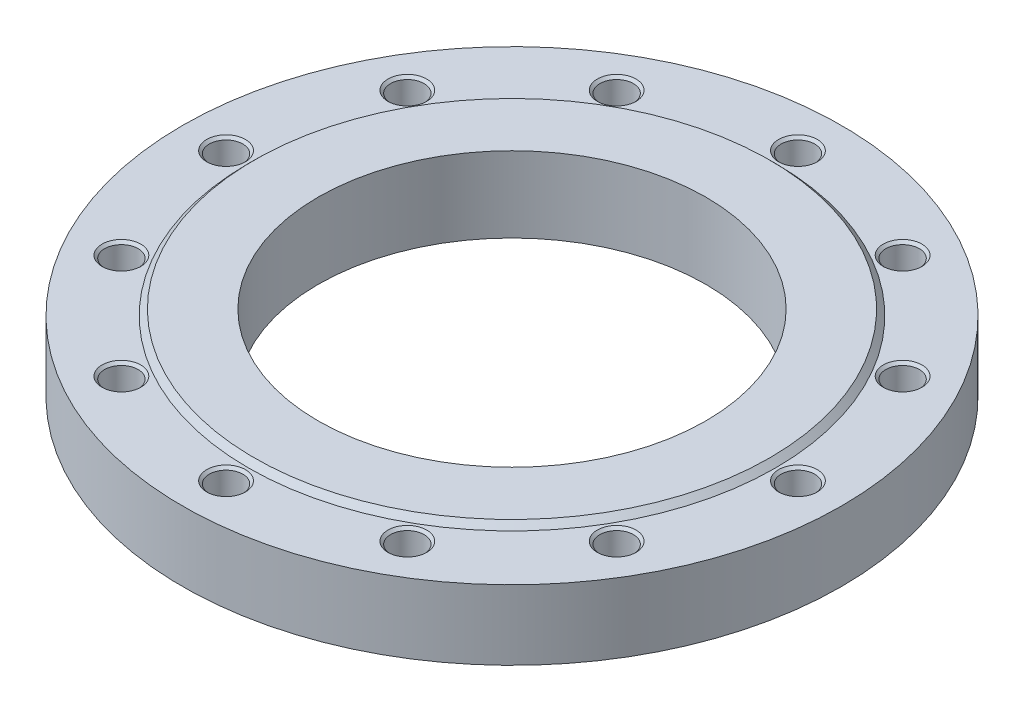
ISO-10303-21;
HEADER;
FILE_DESCRIPTION(('STEP AP214'),'2;1');
FILE_NAME('part.step','',(''),(''),'','','');
FILE_SCHEMA(('AUTOMOTIVE_DESIGN { 1 0 10303 214 1 1 1 1 }'));
ENDSEC;
DATA;
#1=APPLICATION_CONTEXT('core data for automotive mechanical design processes');
#2=APPLICATION_PROTOCOL_DEFINITION('international standard','automotive_design',2000,#1);
#3=PRODUCT_CONTEXT('',#1,'mechanical');
#4=PRODUCT('Part','Part','',(#3));
#5=PRODUCT_RELATED_PRODUCT_CATEGORY('part','',(#4));
#6=PRODUCT_DEFINITION_FORMATION('','',#4);
#7=PRODUCT_DEFINITION_CONTEXT('part definition',#1,'design');
#8=PRODUCT_DEFINITION('design','',#6,#7);
#9=PRODUCT_DEFINITION_SHAPE('','',#8);
#10=(LENGTH_UNIT() NAMED_UNIT(*) SI_UNIT(.MILLI.,.METRE.));
#11=(NAMED_UNIT(*) PLANE_ANGLE_UNIT() SI_UNIT($,.RADIAN.));
#12=(NAMED_UNIT(*) SI_UNIT($,.STERADIAN.) SOLID_ANGLE_UNIT());
#13=UNCERTAINTY_MEASURE_WITH_UNIT(LENGTH_MEASURE(1.E-05),#10,'distance_accuracy_value','');
#14=(GEOMETRIC_REPRESENTATION_CONTEXT(3) GLOBAL_UNCERTAINTY_ASSIGNED_CONTEXT((#13)) GLOBAL_UNIT_ASSIGNED_CONTEXT((#10,
#11,#12)) REPRESENTATION_CONTEXT('',''));
#15=CARTESIAN_POINT('',(0.,0.,0.));
#16=DIRECTION('',(0.,0.,1.));
#17=DIRECTION('',(1.,0.,0.));
#18=AXIS2_PLACEMENT_3D('',#15,#16,#17);
#19=CARTESIAN_POINT('',(0.,18.,0.));
#20=DIRECTION('',(0.,-1.,0.));
#21=DIRECTION('',(1.,0.,0.));
#22=AXIS2_PLACEMENT_3D('',#19,#20,#21);
#23=CYLINDRICAL_SURFACE('',#22,170.);
#24=CARTESIAN_POINT('',(0.,0.,0.));
#25=DIRECTION('',(0.,1.,0.));
#26=DIRECTION('',(1.,0.,0.));
#27=AXIS2_PLACEMENT_3D('',#24,#25,#26);
#28=CIRCLE('',#27,170.);
#29=CARTESIAN_POINT('',(170.,0.,0.));
#30=VERTEX_POINT('',#29);
#31=EDGE_CURVE('E9',#30,#30,#28,.T.);
#32=ORIENTED_EDGE('',*,*,#31,.T.);
#33=EDGE_LOOP('',(#32));
#34=FACE_BOUND('',#33,.T.);
#35=CARTESIAN_POINT('',(0.,36.,0.));
#36=DIRECTION('',(0.,1.,0.));
#37=DIRECTION('',(1.,0.,0.));
#38=AXIS2_PLACEMENT_3D('',#35,#36,#37);
#39=CIRCLE('',#38,170.);
#40=CARTESIAN_POINT('',(170.,36.,0.));
#41=VERTEX_POINT('',#40);
#42=EDGE_CURVE('E197',#41,#41,#39,.T.);
#43=ORIENTED_EDGE('',*,*,#42,.F.);
#44=EDGE_LOOP('',(#43));
#45=FACE_BOUND('',#44,.T.);
#46=ADVANCED_FACE('F15',(#34,#45),#23,.T.);
#47=CARTESIAN_POINT('',(135.,0.,0.));
#48=DIRECTION('',(0.,-1.,0.));
#49=DIRECTION('',(-1.,0.,0.));
#50=AXIS2_PLACEMENT_3D('',#47,#48,#49);
#51=PLANE('',#50);
#52=CARTESIAN_POINT('',(0.,0.,0.));
#53=DIRECTION('',(0.,1.,0.));
#54=DIRECTION('',(1.,0.,0.));
#55=AXIS2_PLACEMENT_3D('',#52,#53,#54);
#56=CIRCLE('',#55,100.);
#57=CARTESIAN_POINT('',(100.,0.,0.));
#58=VERTEX_POINT('',#57);
#59=EDGE_CURVE('E24',#58,#58,#56,.T.);
#60=ORIENTED_EDGE('',*,*,#59,.T.);
#61=EDGE_LOOP('',(#60));
#62=FACE_BOUND('',#61,.T.);
#63=ORIENTED_EDGE('',*,*,#31,.F.);
#64=EDGE_LOOP('',(#63));
#65=FACE_BOUND('',#64,.T.);
#66=ADVANCED_FACE('F407',(#62,#65),#51,.T.);
#67=CARTESIAN_POINT('',(0.,19.5,0.));
#68=DIRECTION('',(0.,-1.,0.));
#69=DIRECTION('',(1.,0.,0.));
#70=AXIS2_PLACEMENT_3D('',#67,#68,#69);
#71=CYLINDRICAL_SURFACE('',#70,100.);
#72=CARTESIAN_POINT('',(0.,39.,0.));
#73=DIRECTION('',(0.,1.,0.));
#74=DIRECTION('',(1.,0.,0.));
#75=AXIS2_PLACEMENT_3D('',#72,#73,#74);
#76=CIRCLE('',#75,100.);
#77=CARTESIAN_POINT('',(100.,39.,0.));
#78=VERTEX_POINT('',#77);
#79=EDGE_CURVE('E190',#78,#78,#76,.T.);
#80=ORIENTED_EDGE('',*,*,#79,.T.);
#81=EDGE_LOOP('',(#80));
#82=FACE_BOUND('',#81,.T.);
#83=ORIENTED_EDGE('',*,*,#59,.F.);
#84=EDGE_LOOP('',(#83));
#85=FACE_BOUND('',#84,.T.);
#86=ADVANCED_FACE('F191',(#82,#85),#71,.F.);
#87=CARTESIAN_POINT('',(116.5,39.,0.));
#88=DIRECTION('',(0.,1.,0.));
#89=DIRECTION('',(1.,0.,0.));
#90=AXIS2_PLACEMENT_3D('',#87,#88,#89);
#91=PLANE('',#90);
#92=CARTESIAN_POINT('',(0.,39.,0.));
#93=DIRECTION('',(0.,1.,0.));
#94=DIRECTION('',(1.,0.,0.));
#95=AXIS2_PLACEMENT_3D('',#92,#93,#94);
#96=CIRCLE('',#95,133.);
#97=CARTESIAN_POINT('',(133.,39.,0.));
#98=VERTEX_POINT('',#97);
#99=EDGE_CURVE('E194',#98,#98,#96,.T.);
#100=ORIENTED_EDGE('',*,*,#99,.T.);
#101=EDGE_LOOP('',(#100));
#102=FACE_BOUND('',#101,.T.);
#103=ORIENTED_EDGE('',*,*,#79,.F.);
#104=EDGE_LOOP('',(#103));
#105=FACE_BOUND('',#104,.T.);
#106=ADVANCED_FACE('F542',(#102,#105),#91,.T.);
#107=CARTESIAN_POINT('',(0.,37.5,0.));
#108=DIRECTION('',(0.,-1.,0.));
#109=DIRECTION('',(1.,0.,0.));
#110=AXIS2_PLACEMENT_3D('',#107,#108,#109);
#111=CONICAL_SURFACE('',#110,134.5,0.785398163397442);
#112=CARTESIAN_POINT('',(0.,36.,0.));
#113=DIRECTION('',(0.,1.,0.));
#114=DIRECTION('',(1.,0.,0.));
#115=AXIS2_PLACEMENT_3D('',#112,#113,#114);
#116=CIRCLE('',#115,136.);
#117=CARTESIAN_POINT('',(136.,36.,0.));
#118=VERTEX_POINT('',#117);
#119=EDGE_CURVE('E18',#118,#118,#116,.T.);
#120=ORIENTED_EDGE('',*,*,#119,.T.);
#121=EDGE_LOOP('',(#120));
#122=FACE_BOUND('',#121,.T.);
#123=ORIENTED_EDGE('',*,*,#99,.F.);
#124=EDGE_LOOP('',(#123));
#125=FACE_BOUND('',#124,.T.);
#126=ADVANCED_FACE('F421',(#122,#125),#111,.T.);
#127=CARTESIAN_POINT('',(153.,36.,0.));
#128=DIRECTION('',(0.,1.,0.));
#129=DIRECTION('',(1.,0.,0.));
#130=AXIS2_PLACEMENT_3D('',#127,#128,#129);
#131=PLANE('',#130);
#132=ORIENTED_EDGE('',*,*,#42,.T.);
#133=EDGE_LOOP('',(#132));
#134=FACE_BOUND('',#133,.T.);
#135=ORIENTED_EDGE('',*,*,#119,.F.);
#136=EDGE_LOOP('',(#135));
#137=FACE_BOUND('',#136,.T.);
#138=CARTESIAN_POINT('',(147.5,36.,0.));
#139=DIRECTION('',(0.,-1.,0.));
#140=DIRECTION('',(1.,0.,0.));
#141=AXIS2_PLACEMENT_3D('',#138,#139,#140);
#142=CIRCLE('',#141,10.);
#143=CARTESIAN_POINT('',(157.5,36.,0.));
#144=VERTEX_POINT('',#143);
#145=EDGE_CURVE('E249',#144,#144,#142,.T.);
#146=ORIENTED_EDGE('',*,*,#145,.T.);
#147=EDGE_LOOP('',(#146));
#148=FACE_BOUND('',#147,.T.);
#149=CARTESIAN_POINT('',(127.738747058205,36.,-73.75));
#150=DIRECTION('',(0.,-1.,0.));
#151=DIRECTION('',(0.866025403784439,0.,-0.5));
#152=AXIS2_PLACEMENT_3D('',#149,#150,#151);
#153=CIRCLE('',#152,10.);
#154=CARTESIAN_POINT('',(136.399001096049,36.,-78.75));
#155=VERTEX_POINT('',#154);
#156=EDGE_CURVE('E226',#155,#155,#153,.T.);
#157=ORIENTED_EDGE('',*,*,#156,.T.);
#158=EDGE_LOOP('',(#157));
#159=FACE_BOUND('',#158,.T.);
#160=CARTESIAN_POINT('',(73.75,36.,-127.738747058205));
#161=DIRECTION('',(0.,-1.,0.));
#162=DIRECTION('',(0.5,0.,-0.866025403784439));
#163=AXIS2_PLACEMENT_3D('',#160,#161,#162);
#164=CIRCLE('',#163,10.);
#165=CARTESIAN_POINT('',(78.75,36.,-136.399001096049));
#166=VERTEX_POINT('',#165);
#167=EDGE_CURVE('E259',#166,#166,#164,.T.);
#168=ORIENTED_EDGE('',*,*,#167,.T.);
#169=EDGE_LOOP('',(#168));
#170=FACE_BOUND('',#169,.T.);
#171=CARTESIAN_POINT('',(0.,36.,-147.5));
#172=DIRECTION('',(0.,-1.,0.));
#173=DIRECTION('',(0.,0.,-1.));
#174=AXIS2_PLACEMENT_3D('',#171,#172,#173);
#175=CIRCLE('',#174,10.);
#176=CARTESIAN_POINT('',(0.,36.,-157.5));
#177=VERTEX_POINT('',#176);
#178=EDGE_CURVE('E243',#177,#177,#175,.T.);
#179=ORIENTED_EDGE('',*,*,#178,.T.);
#180=EDGE_LOOP('',(#179));
#181=FACE_BOUND('',#180,.T.);
#182=CARTESIAN_POINT('',(-73.75,36.,-127.738747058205));
#183=DIRECTION('',(0.,-1.,0.));
#184=DIRECTION('',(-0.5,0.,-0.866025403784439));
#185=AXIS2_PLACEMENT_3D('',#182,#183,#184);
#186=CIRCLE('',#185,10.);
#187=CARTESIAN_POINT('',(-78.75,36.,-136.399001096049));
#188=VERTEX_POINT('',#187);
#189=EDGE_CURVE('E222',#188,#188,#186,.T.);
#190=ORIENTED_EDGE('',*,*,#189,.T.);
#191=EDGE_LOOP('',(#190));
#192=FACE_BOUND('',#191,.T.);
#193=CARTESIAN_POINT('',(-127.738747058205,36.,-73.75));
#194=DIRECTION('',(0.,-1.,0.));
#195=DIRECTION('',(-0.866025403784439,0.,-0.5));
#196=AXIS2_PLACEMENT_3D('',#193,#194,#195);
#197=CIRCLE('',#196,10.);
#198=CARTESIAN_POINT('',(-136.399001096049,36.,-78.75));
#199=VERTEX_POINT('',#198);
#200=EDGE_CURVE('E210',#199,#199,#197,.T.);
#201=ORIENTED_EDGE('',*,*,#200,.T.);
#202=EDGE_LOOP('',(#201));
#203=FACE_BOUND('',#202,.T.);
#204=CARTESIAN_POINT('',(-147.5,36.,0.));
#205=DIRECTION('',(0.,-1.,0.));
#206=DIRECTION('',(-1.,0.,0.));
#207=AXIS2_PLACEMENT_3D('',#204,#205,#206);
#208=CIRCLE('',#207,10.);
#209=CARTESIAN_POINT('',(-157.5,36.,0.));
#210=VERTEX_POINT('',#209);
#211=EDGE_CURVE('E368',#210,#210,#208,.T.);
#212=ORIENTED_EDGE('',*,*,#211,.T.);
#213=EDGE_LOOP('',(#212));
#214=FACE_BOUND('',#213,.T.);
#215=CARTESIAN_POINT('',(-127.738747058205,36.,73.75));
#216=DIRECTION('',(0.,-1.,0.));
#217=DIRECTION('',(-0.866025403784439,0.,0.5));
#218=AXIS2_PLACEMENT_3D('',#215,#216,#217);
#219=CIRCLE('',#218,10.);
#220=CARTESIAN_POINT('',(-136.399001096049,36.,78.75));
#221=VERTEX_POINT('',#220);
#222=EDGE_CURVE('E338',#221,#221,#219,.T.);
#223=ORIENTED_EDGE('',*,*,#222,.T.);
#224=EDGE_LOOP('',(#223));
#225=FACE_BOUND('',#224,.T.);
#226=CARTESIAN_POINT('',(-73.75,36.,127.738747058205));
#227=DIRECTION('',(0.,-1.,0.));
#228=DIRECTION('',(-0.5,0.,0.866025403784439));
#229=AXIS2_PLACEMENT_3D('',#226,#227,#228);
#230=CIRCLE('',#229,10.);
#231=CARTESIAN_POINT('',(-78.75,36.,136.399001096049));
#232=VERTEX_POINT('',#231);
#233=EDGE_CURVE('E344',#232,#232,#230,.T.);
#234=ORIENTED_EDGE('',*,*,#233,.T.);
#235=EDGE_LOOP('',(#234));
#236=FACE_BOUND('',#235,.T.);
#237=CARTESIAN_POINT('',(0.,36.,147.5));
#238=DIRECTION('',(0.,-1.,0.));
#239=DIRECTION('',(0.,0.,1.));
#240=AXIS2_PLACEMENT_3D('',#237,#238,#239);
#241=CIRCLE('',#240,10.);
#242=CARTESIAN_POINT('',(0.,36.,157.5));
#243=VERTEX_POINT('',#242);
#244=EDGE_CURVE('E314',#243,#243,#241,.T.);
#245=ORIENTED_EDGE('',*,*,#244,.T.);
#246=EDGE_LOOP('',(#245));
#247=FACE_BOUND('',#246,.T.);
#248=CARTESIAN_POINT('',(73.75,36.,127.738747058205));
#249=DIRECTION('',(0.,-1.,0.));
#250=DIRECTION('',(0.5,0.,0.866025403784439));
#251=AXIS2_PLACEMENT_3D('',#248,#249,#250);
#252=CIRCLE('',#251,10.);
#253=CARTESIAN_POINT('',(78.75,36.,136.399001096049));
#254=VERTEX_POINT('',#253);
#255=EDGE_CURVE('E294',#254,#254,#252,.T.);
#256=ORIENTED_EDGE('',*,*,#255,.T.);
#257=EDGE_LOOP('',(#256));
#258=FACE_BOUND('',#257,.T.);
#259=CARTESIAN_POINT('',(127.738747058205,36.,73.75));
#260=DIRECTION('',(0.,-1.,0.));
#261=DIRECTION('',(0.866025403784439,0.,0.5));
#262=AXIS2_PLACEMENT_3D('',#259,#260,#261);
#263=CIRCLE('',#262,10.);
#264=CARTESIAN_POINT('',(136.399001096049,36.,78.75));
#265=VERTEX_POINT('',#264);
#266=EDGE_CURVE('E301',#265,#265,#263,.T.);
#267=ORIENTED_EDGE('',*,*,#266,.T.);
#268=EDGE_LOOP('',(#267));
#269=FACE_BOUND('',#268,.T.);
#270=ADVANCED_FACE('F417',(#134,#137,#148,#159,#170,#181,#192,#203,#214,#225,#236,#247,#258,
#269),#131,.T.);
#271=CARTESIAN_POINT('',(147.5,5.50386219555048,0.));
#272=DIRECTION('',(0.,1.,0.));
#273=DIRECTION('',(1.,0.,0.));
#274=AXIS2_PLACEMENT_3D('',#271,#272,#273);
#275=CONICAL_SURFACE('',#274,4.3234375,1.0471975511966);
#276=CARTESIAN_POINT('',(147.5,8.,0.));
#277=DIRECTION('',(0.,-1.,0.));
#278=DIRECTION('',(1.,0.,0.));
#279=AXIS2_PLACEMENT_3D('',#276,#277,#278);
#280=CIRCLE('',#279,8.646875);
#281=CARTESIAN_POINT('',(156.146875,8.,0.));
#282=VERTEX_POINT('',#281);
#283=EDGE_CURVE('E281',#282,#282,#280,.T.);
#284=ORIENTED_EDGE('',*,*,#283,.F.);
#285=EDGE_LOOP('',(#284));
#286=FACE_BOUND('',#285,.T.);
#287=CARTESIAN_POINT('',(147.5,3.00772439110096,0.));
#288=VERTEX_POINT('',#287);
#289=VERTEX_LOOP('',#288);
#290=FACE_BOUND('',#289,.T.);
#291=ADVANCED_FACE('F420',(#286,#290),#275,.F.);
#292=CARTESIAN_POINT('',(147.5,11.3234375,0.));
#293=DIRECTION('',(0.,1.,0.));
#294=DIRECTION('',(1.,0.,0.));
#295=AXIS2_PLACEMENT_3D('',#292,#293,#294);
#296=CYLINDRICAL_SURFACE('',#295,8.646875);
#297=CARTESIAN_POINT('',(147.5,14.646875,0.));
#298=DIRECTION('',(0.,-1.,0.));
#299=DIRECTION('',(1.,0.,0.));
#300=AXIS2_PLACEMENT_3D('',#297,#298,#299);
#301=CIRCLE('',#300,8.646875);
#302=CARTESIAN_POINT('',(156.146875,14.646875,0.));
#303=VERTEX_POINT('',#302);
#304=EDGE_CURVE('E280',#303,#303,#301,.T.);
#305=ORIENTED_EDGE('',*,*,#304,.F.);
#306=EDGE_LOOP('',(#305));
#307=FACE_BOUND('',#306,.T.);
#308=ORIENTED_EDGE('',*,*,#283,.T.);
#309=EDGE_LOOP('',(#308));
#310=FACE_BOUND('',#309,.T.);
#311=ADVANCED_FACE('F577',(#307,#310),#296,.F.);
#312=CARTESIAN_POINT('',(147.5,15.3234375,0.));
#313=DIRECTION('',(0.,1.,0.));
#314=DIRECTION('',(1.,0.,0.));
#315=AXIS2_PLACEMENT_3D('',#312,#313,#314);
#316=CONICAL_SURFACE('',#315,9.3234375,0.785398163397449);
#317=CARTESIAN_POINT('',(147.5,16.,0.));
#318=DIRECTION('',(0.,-1.,0.));
#319=DIRECTION('',(1.,0.,0.));
#320=AXIS2_PLACEMENT_3D('',#317,#318,#319);
#321=CIRCLE('',#320,10.);
#322=CARTESIAN_POINT('',(157.5,16.,0.));
#323=VERTEX_POINT('',#322);
#324=EDGE_CURVE('E248',#323,#323,#321,.T.);
#325=ORIENTED_EDGE('',*,*,#324,.F.);
#326=EDGE_LOOP('',(#325));
#327=FACE_BOUND('',#326,.T.);
#328=ORIENTED_EDGE('',*,*,#304,.T.);
#329=EDGE_LOOP('',(#328));
#330=FACE_BOUND('',#329,.T.);
#331=ADVANCED_FACE('F574',(#327,#330),#316,.F.);
#332=CARTESIAN_POINT('',(156.8234375,16.,0.));
#333=DIRECTION('',(0.,1.,0.));
#334=DIRECTION('',(-1.,0.,0.));
#335=AXIS2_PLACEMENT_3D('',#332,#333,#334);
#336=PLANE('',#335);
#337=CARTESIAN_POINT('',(147.5,16.,0.));
#338=DIRECTION('',(0.,-1.,0.));
#339=DIRECTION('',(1.,0.,0.));
#340=AXIS2_PLACEMENT_3D('',#337,#338,#339);
#341=CIRCLE('',#340,8.646875);
#342=CARTESIAN_POINT('',(156.146875,16.,0.));
#343=VERTEX_POINT('',#342);
#344=EDGE_CURVE('E246',#343,#343,#341,.T.);
#345=ORIENTED_EDGE('',*,*,#344,.F.);
#346=EDGE_LOOP('',(#345));
#347=FACE_BOUND('',#346,.T.);
#348=ORIENTED_EDGE('',*,*,#324,.T.);
#349=EDGE_LOOP('',(#348));
#350=FACE_BOUND('',#349,.T.);
#351=ADVANCED_FACE('F570',(#347,#350),#336,.F.);
#352=CARTESIAN_POINT('',(147.5,25.3234375,0.));
#353=DIRECTION('',(0.,1.,0.));
#354=DIRECTION('',(1.,0.,0.));
#355=AXIS2_PLACEMENT_3D('',#352,#353,#354);
#356=CYLINDRICAL_SURFACE('',#355,8.646875);
#357=CARTESIAN_POINT('',(147.5,34.646875,0.));
#358=DIRECTION('',(0.,-1.,0.));
#359=DIRECTION('',(1.,0.,0.));
#360=AXIS2_PLACEMENT_3D('',#357,#358,#359);
#361=CIRCLE('',#360,8.646875);
#362=CARTESIAN_POINT('',(156.146875,34.646875,0.));
#363=VERTEX_POINT('',#362);
#364=EDGE_CURVE('E278',#363,#363,#361,.T.);
#365=ORIENTED_EDGE('',*,*,#364,.F.);
#366=EDGE_LOOP('',(#365));
#367=FACE_BOUND('',#366,.T.);
#368=ORIENTED_EDGE('',*,*,#344,.T.);
#369=EDGE_LOOP('',(#368));
#370=FACE_BOUND('',#369,.T.);
#371=ADVANCED_FACE('F567',(#367,#370),#356,.F.);
#372=CARTESIAN_POINT('',(147.5,35.3234375,0.));
#373=DIRECTION('',(0.,1.,0.));
#374=DIRECTION('',(1.,0.,0.));
#375=AXIS2_PLACEMENT_3D('',#372,#373,#374);
#376=CONICAL_SURFACE('',#375,9.3234375,0.785398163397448);
#377=ORIENTED_EDGE('',*,*,#145,.F.);
#378=EDGE_LOOP('',(#377));
#379=FACE_BOUND('',#378,.T.);
#380=ORIENTED_EDGE('',*,*,#364,.T.);
#381=EDGE_LOOP('',(#380));
#382=FACE_BOUND('',#381,.T.);
#383=ADVANCED_FACE('F565',(#379,#382),#376,.F.);
#384=CARTESIAN_POINT('',(127.738747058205,5.50386219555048,-73.75));
#385=DIRECTION('',(0.,1.,0.));
#386=DIRECTION('',(0.866025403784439,0.,-0.5));
#387=AXIS2_PLACEMENT_3D('',#384,#385,#386);
#388=CONICAL_SURFACE('',#387,4.3234375,1.0471975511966);
#389=CARTESIAN_POINT('',(127.738747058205,8.,-73.75));
#390=DIRECTION('',(0.,-1.,0.));
#391=DIRECTION('',(0.866025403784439,0.,-0.5));
#392=AXIS2_PLACEMENT_3D('',#389,#390,#391);
#393=CIRCLE('',#392,8.646875);
#394=CARTESIAN_POINT('',(135.227160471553,8.,-78.0734375));
#395=VERTEX_POINT('',#394);
#396=EDGE_CURVE('E231',#395,#395,#393,.T.);
#397=ORIENTED_EDGE('',*,*,#396,.F.);
#398=EDGE_LOOP('',(#397));
#399=FACE_BOUND('',#398,.T.);
#400=CARTESIAN_POINT('',(127.738747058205,3.00772439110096,-73.75));
#401=VERTEX_POINT('',#400);
#402=VERTEX_LOOP('',#401);
#403=FACE_BOUND('',#402,.T.);
#404=ADVANCED_FACE('F561',(#399,#403),#388,.F.);
#405=CARTESIAN_POINT('',(127.738747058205,11.3234375,-73.75));
#406=DIRECTION('',(0.,1.,0.));
#407=DIRECTION('',(0.866025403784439,0.,-0.5));
#408=AXIS2_PLACEMENT_3D('',#405,#406,#407);
#409=CYLINDRICAL_SURFACE('',#408,8.646875);
#410=CARTESIAN_POINT('',(127.738747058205,14.646875,-73.75));
#411=DIRECTION('',(0.,-1.,0.));
#412=DIRECTION('',(0.866025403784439,0.,-0.5));
#413=AXIS2_PLACEMENT_3D('',#410,#411,#412);
#414=CIRCLE('',#413,8.646875);
#415=CARTESIAN_POINT('',(135.227160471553,14.646875,-78.0734375));
#416=VERTEX_POINT('',#415);
#417=EDGE_CURVE('E229',#416,#416,#414,.T.);
#418=ORIENTED_EDGE('',*,*,#417,.F.);
#419=EDGE_LOOP('',(#418));
#420=FACE_BOUND('',#419,.T.);
#421=ORIENTED_EDGE('',*,*,#396,.T.);
#422=EDGE_LOOP('',(#421));
#423=FACE_BOUND('',#422,.T.);
#424=ADVANCED_FACE('F495',(#420,#423),#409,.F.);
#425=CARTESIAN_POINT('',(127.738747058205,15.3234375,-73.75));
#426=DIRECTION('',(0.,1.,0.));
#427=DIRECTION('',(0.866025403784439,0.,-0.5));
#428=AXIS2_PLACEMENT_3D('',#425,#426,#427);
#429=CONICAL_SURFACE('',#428,9.3234375,0.785398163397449);
#430=CARTESIAN_POINT('',(127.738747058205,16.,-73.75));
#431=DIRECTION('',(0.,-1.,0.));
#432=DIRECTION('',(0.866025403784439,0.,-0.5));
#433=AXIS2_PLACEMENT_3D('',#430,#431,#432);
#434=CIRCLE('',#433,10.);
#435=CARTESIAN_POINT('',(136.399001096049,16.,-78.75));
#436=VERTEX_POINT('',#435);
#437=EDGE_CURVE('E225',#436,#436,#434,.T.);
#438=ORIENTED_EDGE('',*,*,#437,.F.);
#439=EDGE_LOOP('',(#438));
#440=FACE_BOUND('',#439,.T.);
#441=ORIENTED_EDGE('',*,*,#417,.T.);
#442=EDGE_LOOP('',(#441));
#443=FACE_BOUND('',#442,.T.);
#444=ADVANCED_FACE('F491',(#440,#443),#429,.F.);
#445=CARTESIAN_POINT('',(135.813080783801,16.,-78.41171875));
#446=DIRECTION('',(0.,1.,0.));
#447=DIRECTION('',(-0.866025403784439,0.,0.5));
#448=AXIS2_PLACEMENT_3D('',#445,#446,#447);
#449=PLANE('',#448);
#450=CARTESIAN_POINT('',(127.738747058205,16.,-73.75));
#451=DIRECTION('',(0.,-1.,0.));
#452=DIRECTION('',(0.866025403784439,0.,-0.5));
#453=AXIS2_PLACEMENT_3D('',#450,#451,#452);
#454=CIRCLE('',#453,8.646875);
#455=CARTESIAN_POINT('',(135.227160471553,16.,-78.0734375));
#456=VERTEX_POINT('',#455);
#457=EDGE_CURVE('E223',#456,#456,#454,.T.);
#458=ORIENTED_EDGE('',*,*,#457,.F.);
#459=EDGE_LOOP('',(#458));
#460=FACE_BOUND('',#459,.T.);
#461=ORIENTED_EDGE('',*,*,#437,.T.);
#462=EDGE_LOOP('',(#461));
#463=FACE_BOUND('',#462,.T.);
#464=ADVANCED_FACE('F494',(#460,#463),#449,.F.);
#465=CARTESIAN_POINT('',(127.738747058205,25.3234375,-73.75));
#466=DIRECTION('',(0.,1.,0.));
#467=DIRECTION('',(0.866025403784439,0.,-0.5));
#468=AXIS2_PLACEMENT_3D('',#465,#466,#467);
#469=CYLINDRICAL_SURFACE('',#468,8.646875);
#470=CARTESIAN_POINT('',(127.738747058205,34.646875,-73.75));
#471=DIRECTION('',(0.,-1.,0.));
#472=DIRECTION('',(0.866025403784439,0.,-0.5));
#473=AXIS2_PLACEMENT_3D('',#470,#471,#472);
#474=CIRCLE('',#473,8.646875);
#475=CARTESIAN_POINT('',(135.227160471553,34.646875,-78.0734375));
#476=VERTEX_POINT('',#475);
#477=EDGE_CURVE('E272',#476,#476,#474,.T.);
#478=ORIENTED_EDGE('',*,*,#477,.F.);
#479=EDGE_LOOP('',(#478));
#480=FACE_BOUND('',#479,.T.);
#481=ORIENTED_EDGE('',*,*,#457,.T.);
#482=EDGE_LOOP('',(#481));
#483=FACE_BOUND('',#482,.T.);
#484=ADVANCED_FACE('F551',(#480,#483),#469,.F.);
#485=CARTESIAN_POINT('',(127.738747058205,35.3234375,-73.75));
#486=DIRECTION('',(0.,1.,0.));
#487=DIRECTION('',(0.866025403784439,0.,-0.5));
#488=AXIS2_PLACEMENT_3D('',#485,#486,#487);
#489=CONICAL_SURFACE('',#488,9.3234375,0.785398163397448);
#490=ORIENTED_EDGE('',*,*,#156,.F.);
#491=EDGE_LOOP('',(#490));
#492=FACE_BOUND('',#491,.T.);
#493=ORIENTED_EDGE('',*,*,#477,.T.);
#494=EDGE_LOOP('',(#493));
#495=FACE_BOUND('',#494,.T.);
#496=ADVANCED_FACE('F547',(#492,#495),#489,.F.);
#497=CARTESIAN_POINT('',(73.75,5.50386219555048,-127.738747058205));
#498=DIRECTION('',(0.,1.,0.));
#499=DIRECTION('',(0.5,0.,-0.866025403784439));
#500=AXIS2_PLACEMENT_3D('',#497,#498,#499);
#501=CONICAL_SURFACE('',#500,4.3234375,1.0471975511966);
#502=CARTESIAN_POINT('',(73.75,8.,-127.738747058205));
#503=DIRECTION('',(0.,-1.,0.));
#504=DIRECTION('',(0.5,0.,-0.866025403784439));
#505=AXIS2_PLACEMENT_3D('',#502,#503,#504);
#506=CIRCLE('',#505,8.646875);
#507=CARTESIAN_POINT('',(78.0734375,8.,-135.227160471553));
#508=VERTEX_POINT('',#507);
#509=EDGE_CURVE('E270',#508,#508,#506,.T.);
#510=ORIENTED_EDGE('',*,*,#509,.F.);
#511=EDGE_LOOP('',(#510));
#512=FACE_BOUND('',#511,.T.);
#513=CARTESIAN_POINT('',(73.75,3.00772439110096,-127.738747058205));
#514=VERTEX_POINT('',#513);
#515=VERTEX_LOOP('',#514);
#516=FACE_BOUND('',#515,.T.);
#517=ADVANCED_FACE('F544',(#512,#516),#501,.F.);
#518=CARTESIAN_POINT('',(73.75,11.3234375,-127.738747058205));
#519=DIRECTION('',(0.,1.,0.));
#520=DIRECTION('',(0.5,0.,-0.866025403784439));
#521=AXIS2_PLACEMENT_3D('',#518,#519,#520);
#522=CYLINDRICAL_SURFACE('',#521,8.646875);
#523=CARTESIAN_POINT('',(73.75,14.646875,-127.738747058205));
#524=DIRECTION('',(0.,-1.,0.));
#525=DIRECTION('',(0.5,0.,-0.866025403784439));
#526=AXIS2_PLACEMENT_3D('',#523,#524,#525);
#527=CIRCLE('',#526,8.646875);
#528=CARTESIAN_POINT('',(78.0734375,14.646875,-135.227160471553));
#529=VERTEX_POINT('',#528);
#530=EDGE_CURVE('E267',#529,#529,#527,.T.);
#531=ORIENTED_EDGE('',*,*,#530,.F.);
#532=EDGE_LOOP('',(#531));
#533=FACE_BOUND('',#532,.T.);
#534=ORIENTED_EDGE('',*,*,#509,.T.);
#535=EDGE_LOOP('',(#534));
#536=FACE_BOUND('',#535,.T.);
#537=ADVANCED_FACE('F538',(#533,#536),#522,.F.);
#538=CARTESIAN_POINT('',(73.75,15.3234375,-127.738747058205));
#539=DIRECTION('',(0.,1.,0.));
#540=DIRECTION('',(0.5,0.,-0.866025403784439));
#541=AXIS2_PLACEMENT_3D('',#538,#539,#540);
#542=CONICAL_SURFACE('',#541,9.3234375,0.785398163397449);
#543=CARTESIAN_POINT('',(73.75,16.,-127.738747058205));
#544=DIRECTION('',(0.,-1.,0.));
#545=DIRECTION('',(0.5,0.,-0.866025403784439));
#546=AXIS2_PLACEMENT_3D('',#543,#544,#545);
#547=CIRCLE('',#546,10.);
#548=CARTESIAN_POINT('',(78.75,16.,-136.399001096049));
#549=VERTEX_POINT('',#548);
#550=EDGE_CURVE('E266',#549,#549,#547,.T.);
#551=ORIENTED_EDGE('',*,*,#550,.F.);
#552=EDGE_LOOP('',(#551));
#553=FACE_BOUND('',#552,.T.);
#554=ORIENTED_EDGE('',*,*,#530,.T.);
#555=EDGE_LOOP('',(#554));
#556=FACE_BOUND('',#555,.T.);
#557=ADVANCED_FACE('F534',(#553,#556),#542,.F.);
#558=CARTESIAN_POINT('',(78.41171875,16.,-135.813080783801));
#559=DIRECTION('',(0.,1.,0.));
#560=DIRECTION('',(-0.5,0.,0.866025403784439));
#561=AXIS2_PLACEMENT_3D('',#558,#559,#560);
#562=PLANE('',#561);
#563=CARTESIAN_POINT('',(73.75,16.,-127.738747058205));
#564=DIRECTION('',(0.,-1.,0.));
#565=DIRECTION('',(0.5,0.,-0.866025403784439));
#566=AXIS2_PLACEMENT_3D('',#563,#564,#565);
#567=CIRCLE('',#566,8.646875);
#568=CARTESIAN_POINT('',(78.0734375,16.,-135.227160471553));
#569=VERTEX_POINT('',#568);
#570=EDGE_CURVE('E261',#569,#569,#567,.T.);
#571=ORIENTED_EDGE('',*,*,#570,.F.);
#572=EDGE_LOOP('',(#571));
#573=FACE_BOUND('',#572,.T.);
#574=ORIENTED_EDGE('',*,*,#550,.T.);
#575=EDGE_LOOP('',(#574));
#576=FACE_BOUND('',#575,.T.);
#577=ADVANCED_FACE('F530',(#573,#576),#562,.F.);
#578=CARTESIAN_POINT('',(73.75,25.3234375,-127.738747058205));
#579=DIRECTION('',(0.,1.,0.));
#580=DIRECTION('',(0.5,0.,-0.866025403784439));
#581=AXIS2_PLACEMENT_3D('',#578,#579,#580);
#582=CYLINDRICAL_SURFACE('',#581,8.646875);
#583=CARTESIAN_POINT('',(73.75,34.646875,-127.738747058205));
#584=DIRECTION('',(0.,-1.,0.));
#585=DIRECTION('',(0.5,0.,-0.866025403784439));
#586=AXIS2_PLACEMENT_3D('',#583,#584,#585);
#587=CIRCLE('',#586,8.646875);
#588=CARTESIAN_POINT('',(78.0734375,34.646875,-135.227160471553));
#589=VERTEX_POINT('',#588);
#590=EDGE_CURVE('E257',#589,#589,#587,.T.);
#591=ORIENTED_EDGE('',*,*,#590,.F.);
#592=EDGE_LOOP('',(#591));
#593=FACE_BOUND('',#592,.T.);
#594=ORIENTED_EDGE('',*,*,#570,.T.);
#595=EDGE_LOOP('',(#594));
#596=FACE_BOUND('',#595,.T.);
#597=ADVANCED_FACE('F526',(#593,#596),#582,.F.);
#598=CARTESIAN_POINT('',(73.75,35.3234375,-127.738747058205));
#599=DIRECTION('',(0.,1.,0.));
#600=DIRECTION('',(0.5,0.,-0.866025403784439));
#601=AXIS2_PLACEMENT_3D('',#598,#599,#600);
#602=CONICAL_SURFACE('',#601,9.3234375,0.785398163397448);
#603=ORIENTED_EDGE('',*,*,#167,.F.);
#604=EDGE_LOOP('',(#603));
#605=FACE_BOUND('',#604,.T.);
#606=ORIENTED_EDGE('',*,*,#590,.T.);
#607=EDGE_LOOP('',(#606));
#608=FACE_BOUND('',#607,.T.);
#609=ADVANCED_FACE('F523',(#605,#608),#602,.F.);
#610=CARTESIAN_POINT('',(0.,5.50386219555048,-147.5));
#611=DIRECTION('',(0.,1.,0.));
#612=DIRECTION('',(0.,0.,-1.));
#613=AXIS2_PLACEMENT_3D('',#610,#611,#612);
#614=CONICAL_SURFACE('',#613,4.3234375,1.0471975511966);
#615=CARTESIAN_POINT('',(0.,8.,-147.5));
#616=DIRECTION('',(0.,-1.,0.));
#617=DIRECTION('',(0.,0.,-1.));
#618=AXIS2_PLACEMENT_3D('',#615,#616,#617);
#619=CIRCLE('',#618,8.646875);
#620=CARTESIAN_POINT('',(0.,8.,-156.146875));
#621=VERTEX_POINT('',#620);
#622=EDGE_CURVE('E254',#621,#621,#619,.T.);
#623=ORIENTED_EDGE('',*,*,#622,.F.);
#624=EDGE_LOOP('',(#623));
#625=FACE_BOUND('',#624,.T.);
#626=CARTESIAN_POINT('',(0.,3.00772439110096,-147.5));
#627=VERTEX_POINT('',#626);
#628=VERTEX_LOOP('',#627);
#629=FACE_BOUND('',#628,.T.);
#630=ADVANCED_FACE('F521',(#625,#629),#614,.F.);
#631=CARTESIAN_POINT('',(0.,11.3234375,-147.5));
#632=DIRECTION('',(0.,1.,0.));
#633=DIRECTION('',(0.,0.,-1.));
#634=AXIS2_PLACEMENT_3D('',#631,#632,#633);
#635=CYLINDRICAL_SURFACE('',#634,8.646875);
#636=CARTESIAN_POINT('',(0.,14.646875,-147.5));
#637=DIRECTION('',(0.,-1.,0.));
#638=DIRECTION('',(0.,0.,-1.));
#639=AXIS2_PLACEMENT_3D('',#636,#637,#638);
#640=CIRCLE('',#639,8.646875);
#641=CARTESIAN_POINT('',(0.,14.646875,-156.146875));
#642=VERTEX_POINT('',#641);
#643=EDGE_CURVE('E252',#642,#642,#640,.T.);
#644=ORIENTED_EDGE('',*,*,#643,.F.);
#645=EDGE_LOOP('',(#644));
#646=FACE_BOUND('',#645,.T.);
#647=ORIENTED_EDGE('',*,*,#622,.T.);
#648=EDGE_LOOP('',(#647));
#649=FACE_BOUND('',#648,.T.);
#650=ADVANCED_FACE('F517',(#646,#649),#635,.F.);
#651=CARTESIAN_POINT('',(0.,15.3234375,-147.5));
#652=DIRECTION('',(0.,1.,0.));
#653=DIRECTION('',(0.,0.,-1.));
#654=AXIS2_PLACEMENT_3D('',#651,#652,#653);
#655=CONICAL_SURFACE('',#654,9.3234375,0.785398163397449);
#656=CARTESIAN_POINT('',(0.,16.,-147.5));
#657=DIRECTION('',(0.,-1.,0.));
#658=DIRECTION('',(0.,0.,-1.));
#659=AXIS2_PLACEMENT_3D('',#656,#657,#658);
#660=CIRCLE('',#659,10.);
#661=CARTESIAN_POINT('',(0.,16.,-157.5));
#662=VERTEX_POINT('',#661);
#663=EDGE_CURVE('E251',#662,#662,#660,.T.);
#664=ORIENTED_EDGE('',*,*,#663,.F.);
#665=EDGE_LOOP('',(#664));
#666=FACE_BOUND('',#665,.T.);
#667=ORIENTED_EDGE('',*,*,#643,.T.);
#668=EDGE_LOOP('',(#667));
#669=FACE_BOUND('',#668,.T.);
#670=ADVANCED_FACE('F513',(#666,#669),#655,.F.);
#671=CARTESIAN_POINT('',(0.,16.,-156.8234375));
#672=DIRECTION('',(0.,1.,0.));
#673=DIRECTION('',(0.,0.,1.));
#674=AXIS2_PLACEMENT_3D('',#671,#672,#673);
#675=PLANE('',#674);
#676=CARTESIAN_POINT('',(0.,16.,-147.5));
#677=DIRECTION('',(0.,-1.,0.));
#678=DIRECTION('',(0.,0.,-1.));
#679=AXIS2_PLACEMENT_3D('',#676,#677,#678);
#680=CIRCLE('',#679,8.646875);
#681=CARTESIAN_POINT('',(0.,16.,-156.146875));
#682=VERTEX_POINT('',#681);
#683=EDGE_CURVE('E245',#682,#682,#680,.T.);
#684=ORIENTED_EDGE('',*,*,#683,.F.);
#685=EDGE_LOOP('',(#684));
#686=FACE_BOUND('',#685,.T.);
#687=ORIENTED_EDGE('',*,*,#663,.T.);
#688=EDGE_LOOP('',(#687));
#689=FACE_BOUND('',#688,.T.);
#690=ADVANCED_FACE('F510',(#686,#689),#675,.F.);
#691=CARTESIAN_POINT('',(0.,25.3234375,-147.5));
#692=DIRECTION('',(0.,1.,0.));
#693=DIRECTION('',(0.,0.,-1.));
#694=AXIS2_PLACEMENT_3D('',#691,#692,#693);
#695=CYLINDRICAL_SURFACE('',#694,8.646875);
#696=CARTESIAN_POINT('',(0.,34.646875,-147.5));
#697=DIRECTION('',(0.,-1.,0.));
#698=DIRECTION('',(0.,0.,-1.));
#699=AXIS2_PLACEMENT_3D('',#696,#697,#698);
#700=CIRCLE('',#699,8.646875);
#701=CARTESIAN_POINT('',(0.,34.646875,-156.146875));
#702=VERTEX_POINT('',#701);
#703=EDGE_CURVE('E240',#702,#702,#700,.T.);
#704=ORIENTED_EDGE('',*,*,#703,.F.);
#705=EDGE_LOOP('',(#704));
#706=FACE_BOUND('',#705,.T.);
#707=ORIENTED_EDGE('',*,*,#683,.T.);
#708=EDGE_LOOP('',(#707));
#709=FACE_BOUND('',#708,.T.);
#710=ADVANCED_FACE('F508',(#706,#709),#695,.F.);
#711=CARTESIAN_POINT('',(0.,35.3234375,-147.5));
#712=DIRECTION('',(0.,1.,0.));
#713=DIRECTION('',(0.,0.,-1.));
#714=AXIS2_PLACEMENT_3D('',#711,#712,#713);
#715=CONICAL_SURFACE('',#714,9.3234375,0.785398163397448);
#716=ORIENTED_EDGE('',*,*,#178,.F.);
#717=EDGE_LOOP('',(#716));
#718=FACE_BOUND('',#717,.T.);
#719=ORIENTED_EDGE('',*,*,#703,.T.);
#720=EDGE_LOOP('',(#719));
#721=FACE_BOUND('',#720,.T.);
#722=ADVANCED_FACE('F504',(#718,#721),#715,.F.);
#723=CARTESIAN_POINT('',(-73.75,5.50386219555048,-127.738747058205));
#724=DIRECTION('',(0.,1.,0.));
#725=DIRECTION('',(-0.5,0.,-0.866025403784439));
#726=AXIS2_PLACEMENT_3D('',#723,#724,#725);
#727=CONICAL_SURFACE('',#726,4.3234375,1.0471975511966);
#728=CARTESIAN_POINT('',(-73.75,8.,-127.738747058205));
#729=DIRECTION('',(0.,-1.,0.));
#730=DIRECTION('',(-0.5,0.,-0.866025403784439));
#731=AXIS2_PLACEMENT_3D('',#728,#729,#730);
#732=CIRCLE('',#731,8.646875);
#733=CARTESIAN_POINT('',(-78.0734375,8.,-135.227160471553));
#734=VERTEX_POINT('',#733);
#735=EDGE_CURVE('E238',#734,#734,#732,.T.);
#736=ORIENTED_EDGE('',*,*,#735,.F.);
#737=EDGE_LOOP('',(#736));
#738=FACE_BOUND('',#737,.T.);
#739=CARTESIAN_POINT('',(-73.75,3.00772439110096,-127.738747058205));
#740=VERTEX_POINT('',#739);
#741=VERTEX_LOOP('',#740);
#742=FACE_BOUND('',#741,.T.);
#743=ADVANCED_FACE('F501',(#738,#742),#727,.F.);
#744=CARTESIAN_POINT('',(-73.75,11.3234375,-127.738747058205));
#745=DIRECTION('',(0.,1.,0.));
#746=DIRECTION('',(-0.5,0.,-0.866025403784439));
#747=AXIS2_PLACEMENT_3D('',#744,#745,#746);
#748=CYLINDRICAL_SURFACE('',#747,8.646875);
#749=CARTESIAN_POINT('',(-73.75,14.646875,-127.738747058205));
#750=DIRECTION('',(0.,-1.,0.));
#751=DIRECTION('',(-0.5,0.,-0.866025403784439));
#752=AXIS2_PLACEMENT_3D('',#749,#750,#751);
#753=CIRCLE('',#752,8.646875);
#754=CARTESIAN_POINT('',(-78.0734375,14.646875,-135.227160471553));
#755=VERTEX_POINT('',#754);
#756=EDGE_CURVE('E236',#755,#755,#753,.T.);
#757=ORIENTED_EDGE('',*,*,#756,.F.);
#758=EDGE_LOOP('',(#757));
#759=FACE_BOUND('',#758,.T.);
#760=ORIENTED_EDGE('',*,*,#735,.T.);
#761=EDGE_LOOP('',(#760));
#762=FACE_BOUND('',#761,.T.);
#763=ADVANCED_FACE('F499',(#759,#762),#748,.F.);
#764=CARTESIAN_POINT('',(-73.75,15.3234375,-127.738747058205));
#765=DIRECTION('',(0.,1.,0.));
#766=DIRECTION('',(-0.5,0.,-0.866025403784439));
#767=AXIS2_PLACEMENT_3D('',#764,#765,#766);
#768=CONICAL_SURFACE('',#767,9.3234375,0.785398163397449);
#769=CARTESIAN_POINT('',(-73.75,16.,-127.738747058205));
#770=DIRECTION('',(0.,-1.,0.));
#771=DIRECTION('',(-0.5,0.,-0.866025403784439));
#772=AXIS2_PLACEMENT_3D('',#769,#770,#771);
#773=CIRCLE('',#772,10.);
#774=CARTESIAN_POINT('',(-78.75,16.,-136.399001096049));
#775=VERTEX_POINT('',#774);
#776=EDGE_CURVE('E233',#775,#775,#773,.T.);
#777=ORIENTED_EDGE('',*,*,#776,.F.);
#778=EDGE_LOOP('',(#777));
#779=FACE_BOUND('',#778,.T.);
#780=ORIENTED_EDGE('',*,*,#756,.T.);
#781=EDGE_LOOP('',(#780));
#782=FACE_BOUND('',#781,.T.);
#783=ADVANCED_FACE('F489',(#779,#782),#768,.F.);
#784=CARTESIAN_POINT('',(-78.41171875,16.,-135.813080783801));
#785=DIRECTION('',(0.,1.,0.));
#786=DIRECTION('',(0.5,0.,0.866025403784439));
#787=AXIS2_PLACEMENT_3D('',#784,#785,#786);
#788=PLANE('',#787);
#789=CARTESIAN_POINT('',(-73.75,16.,-127.738747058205));
#790=DIRECTION('',(0.,-1.,0.));
#791=DIRECTION('',(-0.5,0.,-0.866025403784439));
#792=AXIS2_PLACEMENT_3D('',#789,#790,#791);
#793=CIRCLE('',#792,8.646875);
#794=CARTESIAN_POINT('',(-78.0734375,16.,-135.227160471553));
#795=VERTEX_POINT('',#794);
#796=EDGE_CURVE('E228',#795,#795,#793,.T.);
#797=ORIENTED_EDGE('',*,*,#796,.F.);
#798=EDGE_LOOP('',(#797));
#799=FACE_BOUND('',#798,.T.);
#800=ORIENTED_EDGE('',*,*,#776,.T.);
#801=EDGE_LOOP('',(#800));
#802=FACE_BOUND('',#801,.T.);
#803=ADVANCED_FACE('F485',(#799,#802),#788,.F.);
#804=CARTESIAN_POINT('',(-73.75,25.3234375,-127.738747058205));
#805=DIRECTION('',(0.,1.,0.));
#806=DIRECTION('',(-0.5,0.,-0.866025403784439));
#807=AXIS2_PLACEMENT_3D('',#804,#805,#806);
#808=CYLINDRICAL_SURFACE('',#807,8.646875);
#809=CARTESIAN_POINT('',(-73.75,34.646875,-127.738747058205));
#810=DIRECTION('',(0.,-1.,0.));
#811=DIRECTION('',(-0.5,0.,-0.866025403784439));
#812=AXIS2_PLACEMENT_3D('',#809,#810,#811);
#813=CIRCLE('',#812,8.646875);
#814=CARTESIAN_POINT('',(-78.0734375,34.646875,-135.227160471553));
#815=VERTEX_POINT('',#814);
#816=EDGE_CURVE('E220',#815,#815,#813,.T.);
#817=ORIENTED_EDGE('',*,*,#816,.F.);
#818=EDGE_LOOP('',(#817));
#819=FACE_BOUND('',#818,.T.);
#820=ORIENTED_EDGE('',*,*,#796,.T.);
#821=EDGE_LOOP('',(#820));
#822=FACE_BOUND('',#821,.T.);
#823=ADVANCED_FACE('F478',(#819,#822),#808,.F.);
#824=CARTESIAN_POINT('',(-73.75,35.3234375,-127.738747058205));
#825=DIRECTION('',(0.,1.,0.));
#826=DIRECTION('',(-0.5,0.,-0.866025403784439));
#827=AXIS2_PLACEMENT_3D('',#824,#825,#826);
#828=CONICAL_SURFACE('',#827,9.3234375,0.785398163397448);
#829=ORIENTED_EDGE('',*,*,#189,.F.);
#830=EDGE_LOOP('',(#829));
#831=FACE_BOUND('',#830,.T.);
#832=ORIENTED_EDGE('',*,*,#816,.T.);
#833=EDGE_LOOP('',(#832));
#834=FACE_BOUND('',#833,.T.);
#835=ADVANCED_FACE('F469',(#831,#834),#828,.F.);
#836=CARTESIAN_POINT('',(-127.738747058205,5.50386219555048,-73.75));
#837=DIRECTION('',(0.,1.,0.));
#838=DIRECTION('',(-0.866025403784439,0.,-0.5));
#839=AXIS2_PLACEMENT_3D('',#836,#837,#838);
#840=CONICAL_SURFACE('',#839,4.3234375,1.0471975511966);
#841=CARTESIAN_POINT('',(-127.738747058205,8.,-73.75));
#842=DIRECTION('',(0.,-1.,0.));
#843=DIRECTION('',(-0.866025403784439,0.,-0.5));
#844=AXIS2_PLACEMENT_3D('',#841,#842,#843);
#845=CIRCLE('',#844,8.646875);
#846=CARTESIAN_POINT('',(-135.227160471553,8.,-78.0734375));
#847=VERTEX_POINT('',#846);
#848=EDGE_CURVE('E219',#847,#847,#845,.T.);
#849=ORIENTED_EDGE('',*,*,#848,.F.);
#850=EDGE_LOOP('',(#849));
#851=FACE_BOUND('',#850,.T.);
#852=CARTESIAN_POINT('',(-127.738747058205,3.00772439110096,-73.75));
#853=VERTEX_POINT('',#852);
#854=VERTEX_LOOP('',#853);
#855=FACE_BOUND('',#854,.T.);
#856=ADVANCED_FACE('F466',(#851,#855),#840,.F.);
#857=CARTESIAN_POINT('',(-127.738747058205,11.3234375,-73.75));
#858=DIRECTION('',(0.,1.,0.));
#859=DIRECTION('',(-0.866025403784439,0.,-0.5));
#860=AXIS2_PLACEMENT_3D('',#857,#858,#859);
#861=CYLINDRICAL_SURFACE('',#860,8.646875);
#862=CARTESIAN_POINT('',(-127.738747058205,14.646875,-73.75));
#863=DIRECTION('',(0.,-1.,0.));
#864=DIRECTION('',(-0.866025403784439,0.,-0.5));
#865=AXIS2_PLACEMENT_3D('',#862,#863,#864);
#866=CIRCLE('',#865,8.646875);
#867=CARTESIAN_POINT('',(-135.227160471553,14.646875,-78.0734375));
#868=VERTEX_POINT('',#867);
#869=EDGE_CURVE('E217',#868,#868,#866,.T.);
#870=ORIENTED_EDGE('',*,*,#869,.F.);
#871=EDGE_LOOP('',(#870));
#872=FACE_BOUND('',#871,.T.);
#873=ORIENTED_EDGE('',*,*,#848,.T.);
#874=EDGE_LOOP('',(#873));
#875=FACE_BOUND('',#874,.T.);
#876=ADVANCED_FACE('F464',(#872,#875),#861,.F.);
#877=CARTESIAN_POINT('',(-127.738747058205,15.3234375,-73.75));
#878=DIRECTION('',(0.,1.,0.));
#879=DIRECTION('',(-0.866025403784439,0.,-0.5));
#880=AXIS2_PLACEMENT_3D('',#877,#878,#879);
#881=CONICAL_SURFACE('',#880,9.3234375,0.785398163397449);
#882=CARTESIAN_POINT('',(-127.738747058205,16.,-73.75));
#883=DIRECTION('',(0.,-1.,0.));
#884=DIRECTION('',(-0.866025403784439,0.,-0.5));
#885=AXIS2_PLACEMENT_3D('',#882,#883,#884);
#886=CIRCLE('',#885,10.);
#887=CARTESIAN_POINT('',(-136.399001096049,16.,-78.75));
#888=VERTEX_POINT('',#887);
#889=EDGE_CURVE('E215',#888,#888,#886,.T.);
#890=ORIENTED_EDGE('',*,*,#889,.F.);
#891=EDGE_LOOP('',(#890));
#892=FACE_BOUND('',#891,.T.);
#893=ORIENTED_EDGE('',*,*,#869,.T.);
#894=EDGE_LOOP('',(#893));
#895=FACE_BOUND('',#894,.T.);
#896=ADVANCED_FACE('F475',(#892,#895),#881,.F.);
#897=CARTESIAN_POINT('',(-135.813080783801,16.,-78.41171875));
#898=DIRECTION('',(0.,1.,0.));
#899=DIRECTION('',(0.866025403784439,0.,0.5));
#900=AXIS2_PLACEMENT_3D('',#897,#898,#899);
#901=PLANE('',#900);
#902=CARTESIAN_POINT('',(-127.738747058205,16.,-73.75));
#903=DIRECTION('',(0.,-1.,0.));
#904=DIRECTION('',(-0.866025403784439,0.,-0.5));
#905=AXIS2_PLACEMENT_3D('',#902,#903,#904);
#906=CIRCLE('',#905,8.646875);
#907=CARTESIAN_POINT('',(-135.227160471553,16.,-78.0734375));
#908=VERTEX_POINT('',#907);
#909=EDGE_CURVE('E213',#908,#908,#906,.T.);
#910=ORIENTED_EDGE('',*,*,#909,.F.);
#911=EDGE_LOOP('',(#910));
#912=FACE_BOUND('',#911,.T.);
#913=ORIENTED_EDGE('',*,*,#889,.T.);
#914=EDGE_LOOP('',(#913));
#915=FACE_BOUND('',#914,.T.);
#916=ADVANCED_FACE('F697',(#912,#915),#901,.F.);
#917=CARTESIAN_POINT('',(-127.738747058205,25.3234375,-73.75));
#918=DIRECTION('',(0.,1.,0.));
#919=DIRECTION('',(-0.866025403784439,0.,-0.5));
#920=AXIS2_PLACEMENT_3D('',#917,#918,#919);
#921=CYLINDRICAL_SURFACE('',#920,8.646875);
#922=CARTESIAN_POINT('',(-127.738747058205,34.646875,-73.75));
#923=DIRECTION('',(0.,-1.,0.));
#924=DIRECTION('',(-0.866025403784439,0.,-0.5));
#925=AXIS2_PLACEMENT_3D('',#922,#923,#924);
#926=CIRCLE('',#925,8.646875);
#927=CARTESIAN_POINT('',(-135.227160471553,34.646875,-78.0734375));
#928=VERTEX_POINT('',#927);
#929=EDGE_CURVE('E208',#928,#928,#926,.T.);
#930=ORIENTED_EDGE('',*,*,#929,.F.);
#931=EDGE_LOOP('',(#930));
#932=FACE_BOUND('',#931,.T.);
#933=ORIENTED_EDGE('',*,*,#909,.T.);
#934=EDGE_LOOP('',(#933));
#935=FACE_BOUND('',#934,.T.);
#936=ADVANCED_FACE('F403',(#932,#935),#921,.F.);
#937=CARTESIAN_POINT('',(-127.738747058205,35.3234375,-73.75));
#938=DIRECTION('',(0.,1.,0.));
#939=DIRECTION('',(-0.866025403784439,0.,-0.5));
#940=AXIS2_PLACEMENT_3D('',#937,#938,#939);
#941=CONICAL_SURFACE('',#940,9.3234375,0.785398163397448);
#942=ORIENTED_EDGE('',*,*,#200,.F.);
#943=EDGE_LOOP('',(#942));
#944=FACE_BOUND('',#943,.T.);
#945=ORIENTED_EDGE('',*,*,#929,.T.);
#946=EDGE_LOOP('',(#945));
#947=FACE_BOUND('',#946,.T.);
#948=ADVANCED_FACE('F397',(#944,#947),#941,.F.);
#949=CARTESIAN_POINT('',(-147.5,5.50386219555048,0.));
#950=DIRECTION('',(0.,1.,0.));
#951=DIRECTION('',(-1.,0.,0.));
#952=AXIS2_PLACEMENT_3D('',#949,#950,#951);
#953=CONICAL_SURFACE('',#952,4.3234375,1.0471975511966);
#954=CARTESIAN_POINT('',(-147.5,8.,0.));
#955=DIRECTION('',(0.,-1.,0.));
#956=DIRECTION('',(-1.,0.,0.));
#957=AXIS2_PLACEMENT_3D('',#954,#955,#956);
#958=CIRCLE('',#957,8.646875);
#959=CARTESIAN_POINT('',(-156.146875,8.,0.));
#960=VERTEX_POINT('',#959);
#961=EDGE_CURVE('E207',#960,#960,#958,.T.);
#962=ORIENTED_EDGE('',*,*,#961,.F.);
#963=EDGE_LOOP('',(#962));
#964=FACE_BOUND('',#963,.T.);
#965=CARTESIAN_POINT('',(-147.5,3.00772439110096,0.));
#966=VERTEX_POINT('',#965);
#967=VERTEX_LOOP('',#966);
#968=FACE_BOUND('',#967,.T.);
#969=ADVANCED_FACE('F391',(#964,#968),#953,.F.);
#970=CARTESIAN_POINT('',(-147.5,11.3234375,0.));
#971=DIRECTION('',(0.,1.,0.));
#972=DIRECTION('',(-1.,0.,0.));
#973=AXIS2_PLACEMENT_3D('',#970,#971,#972);
#974=CYLINDRICAL_SURFACE('',#973,8.646875);
#975=CARTESIAN_POINT('',(-147.5,14.646875,0.));
#976=DIRECTION('',(0.,-1.,0.));
#977=DIRECTION('',(-1.,0.,0.));
#978=AXIS2_PLACEMENT_3D('',#975,#976,#977);
#979=CIRCLE('',#978,8.646875);
#980=CARTESIAN_POINT('',(-156.146875,14.646875,0.));
#981=VERTEX_POINT('',#980);
#982=EDGE_CURVE('E205',#981,#981,#979,.T.);
#983=ORIENTED_EDGE('',*,*,#982,.F.);
#984=EDGE_LOOP('',(#983));
#985=FACE_BOUND('',#984,.T.);
#986=ORIENTED_EDGE('',*,*,#961,.T.);
#987=EDGE_LOOP('',(#986));
#988=FACE_BOUND('',#987,.T.);
#989=ADVANCED_FACE('F385',(#985,#988),#974,.F.);
#990=CARTESIAN_POINT('',(-147.5,15.3234375,0.));
#991=DIRECTION('',(0.,1.,0.));
#992=DIRECTION('',(-1.,0.,0.));
#993=AXIS2_PLACEMENT_3D('',#990,#991,#992);
#994=CONICAL_SURFACE('',#993,9.3234375,0.785398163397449);
#995=CARTESIAN_POINT('',(-147.5,16.,0.));
#996=DIRECTION('',(0.,-1.,0.));
#997=DIRECTION('',(-1.,0.,0.));
#998=AXIS2_PLACEMENT_3D('',#995,#996,#997);
#999=CIRCLE('',#998,10.);
#1000=CARTESIAN_POINT('',(-157.5,16.,0.));
#1001=VERTEX_POINT('',#1000);
#1002=EDGE_CURVE('E202',#1001,#1001,#999,.T.);
#1003=ORIENTED_EDGE('',*,*,#1002,.F.);
#1004=EDGE_LOOP('',(#1003));
#1005=FACE_BOUND('',#1004,.T.);
#1006=ORIENTED_EDGE('',*,*,#982,.T.);
#1007=EDGE_LOOP('',(#1006));
#1008=FACE_BOUND('',#1007,.T.);
#1009=ADVANCED_FACE('F378',(#1005,#1008),#994,.F.);
#1010=CARTESIAN_POINT('',(-156.8234375,16.,0.));
#1011=DIRECTION('',(0.,1.,0.));
#1012=DIRECTION('',(1.,0.,0.));
#1013=AXIS2_PLACEMENT_3D('',#1010,#1011,#1012);
#1014=PLANE('',#1013);
#1015=CARTESIAN_POINT('',(-147.5,16.,0.));
#1016=DIRECTION('',(0.,-1.,0.));
#1017=DIRECTION('',(-1.,0.,0.));
#1018=AXIS2_PLACEMENT_3D('',#1015,#1016,#1017);
#1019=CIRCLE('',#1018,8.646875);
#1020=CARTESIAN_POINT('',(-156.146875,16.,0.));
#1021=VERTEX_POINT('',#1020);
#1022=EDGE_CURVE('E201',#1021,#1021,#1019,.T.);
#1023=ORIENTED_EDGE('',*,*,#1022,.F.);
#1024=EDGE_LOOP('',(#1023));
#1025=FACE_BOUND('',#1024,.T.);
#1026=ORIENTED_EDGE('',*,*,#1002,.T.);
#1027=EDGE_LOOP('',(#1026));
#1028=FACE_BOUND('',#1027,.T.);
#1029=ADVANCED_FACE('F375',(#1025,#1028),#1014,.F.);
#1030=CARTESIAN_POINT('',(-147.5,25.3234375,0.));
#1031=DIRECTION('',(0.,1.,0.));
#1032=DIRECTION('',(-1.,0.,0.));
#1033=AXIS2_PLACEMENT_3D('',#1030,#1031,#1032);
#1034=CYLINDRICAL_SURFACE('',#1033,8.646875);
#1035=CARTESIAN_POINT('',(-147.5,34.646875,0.));
#1036=DIRECTION('',(0.,-1.,0.));
#1037=DIRECTION('',(-1.,0.,0.));
#1038=AXIS2_PLACEMENT_3D('',#1035,#1036,#1037);
#1039=CIRCLE('',#1038,8.646875);
#1040=CARTESIAN_POINT('',(-156.146875,34.646875,0.));
#1041=VERTEX_POINT('',#1040);
#1042=EDGE_CURVE('E307',#1041,#1041,#1039,.T.);
#1043=ORIENTED_EDGE('',*,*,#1042,.F.);
#1044=EDGE_LOOP('',(#1043));
#1045=FACE_BOUND('',#1044,.T.);
#1046=ORIENTED_EDGE('',*,*,#1022,.T.);
#1047=EDGE_LOOP('',(#1046));
#1048=FACE_BOUND('',#1047,.T.);
#1049=ADVANCED_FACE('F373',(#1045,#1048),#1034,.F.);
#1050=CARTESIAN_POINT('',(-147.5,35.3234375,0.));
#1051=DIRECTION('',(0.,1.,0.));
#1052=DIRECTION('',(-1.,0.,0.));
#1053=AXIS2_PLACEMENT_3D('',#1050,#1051,#1052);
#1054=CONICAL_SURFACE('',#1053,9.3234375,0.785398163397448);
#1055=ORIENTED_EDGE('',*,*,#211,.F.);
#1056=EDGE_LOOP('',(#1055));
#1057=FACE_BOUND('',#1056,.T.);
#1058=ORIENTED_EDGE('',*,*,#1042,.T.);
#1059=EDGE_LOOP('',(#1058));
#1060=FACE_BOUND('',#1059,.T.);
#1061=ADVANCED_FACE('F592',(#1057,#1060),#1054,.F.);
#1062=CARTESIAN_POINT('',(-127.738747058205,5.50386219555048,73.75));
#1063=DIRECTION('',(0.,1.,0.));
#1064=DIRECTION('',(-0.866025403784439,0.,0.5));
#1065=AXIS2_PLACEMENT_3D('',#1062,#1063,#1064);
#1066=CONICAL_SURFACE('',#1065,4.3234375,1.0471975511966);
#1067=CARTESIAN_POINT('',(-127.738747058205,8.,73.75));
#1068=DIRECTION('',(0.,-1.,0.));
#1069=DIRECTION('',(-0.866025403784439,0.,0.5));
#1070=AXIS2_PLACEMENT_3D('',#1067,#1068,#1069);
#1071=CIRCLE('',#1070,8.646875);
#1072=CARTESIAN_POINT('',(-135.227160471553,8.,78.0734374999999));
#1073=VERTEX_POINT('',#1072);
#1074=EDGE_CURVE('E305',#1073,#1073,#1071,.T.);
#1075=ORIENTED_EDGE('',*,*,#1074,.F.);
#1076=EDGE_LOOP('',(#1075));
#1077=FACE_BOUND('',#1076,.T.);
#1078=CARTESIAN_POINT('',(-127.738747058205,3.00772439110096,73.75));
#1079=VERTEX_POINT('',#1078);
#1080=VERTEX_LOOP('',#1079);
#1081=FACE_BOUND('',#1080,.T.);
#1082=ADVANCED_FACE('F596',(#1077,#1081),#1066,.F.);
#1083=CARTESIAN_POINT('',(-127.738747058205,11.3234375,73.75));
#1084=DIRECTION('',(0.,1.,0.));
#1085=DIRECTION('',(-0.866025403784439,0.,0.5));
#1086=AXIS2_PLACEMENT_3D('',#1083,#1084,#1085);
#1087=CYLINDRICAL_SURFACE('',#1086,8.646875);
#1088=CARTESIAN_POINT('',(-127.738747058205,14.646875,73.75));
#1089=DIRECTION('',(0.,-1.,0.));
#1090=DIRECTION('',(-0.866025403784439,0.,0.5));
#1091=AXIS2_PLACEMENT_3D('',#1088,#1089,#1090);
#1092=CIRCLE('',#1091,8.646875);
#1093=CARTESIAN_POINT('',(-135.227160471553,14.646875,78.0734374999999));
#1094=VERTEX_POINT('',#1093);
#1095=EDGE_CURVE('E308',#1094,#1094,#1092,.T.);
#1096=ORIENTED_EDGE('',*,*,#1095,.F.);
#1097=EDGE_LOOP('',(#1096));
#1098=FACE_BOUND('',#1097,.T.);
#1099=ORIENTED_EDGE('',*,*,#1074,.T.);
#1100=EDGE_LOOP('',(#1099));
#1101=FACE_BOUND('',#1100,.T.);
#1102=ADVANCED_FACE('F600',(#1098,#1101),#1087,.F.);
#1103=CARTESIAN_POINT('',(-127.738747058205,15.3234375,73.75));
#1104=DIRECTION('',(0.,1.,0.));
#1105=DIRECTION('',(-0.866025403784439,0.,0.5));
#1106=AXIS2_PLACEMENT_3D('',#1103,#1104,#1105);
#1107=CONICAL_SURFACE('',#1106,9.3234375,0.785398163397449);
#1108=CARTESIAN_POINT('',(-127.738747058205,16.,73.75));
#1109=DIRECTION('',(0.,-1.,0.));
#1110=DIRECTION('',(-0.866025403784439,0.,0.5));
#1111=AXIS2_PLACEMENT_3D('',#1108,#1109,#1110);
#1112=CIRCLE('',#1111,10.);
#1113=CARTESIAN_POINT('',(-136.399001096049,16.,78.75));
#1114=VERTEX_POINT('',#1113);
#1115=EDGE_CURVE('E337',#1114,#1114,#1112,.T.);
#1116=ORIENTED_EDGE('',*,*,#1115,.F.);
#1117=EDGE_LOOP('',(#1116));
#1118=FACE_BOUND('',#1117,.T.);
#1119=ORIENTED_EDGE('',*,*,#1095,.T.);
#1120=EDGE_LOOP('',(#1119));
#1121=FACE_BOUND('',#1120,.T.);
#1122=ADVANCED_FACE('F604',(#1118,#1121),#1107,.F.);
#1123=CARTESIAN_POINT('',(-135.813080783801,16.,78.41171875));
#1124=DIRECTION('',(0.,1.,0.));
#1125=DIRECTION('',(0.866025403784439,0.,-0.5));
#1126=AXIS2_PLACEMENT_3D('',#1123,#1124,#1125);
#1127=PLANE('',#1126);
#1128=CARTESIAN_POINT('',(-127.738747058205,16.,73.75));
#1129=DIRECTION('',(0.,-1.,0.));
#1130=DIRECTION('',(-0.866025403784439,0.,0.5));
#1131=AXIS2_PLACEMENT_3D('',#1128,#1129,#1130);
#1132=CIRCLE('',#1131,8.646875);
#1133=CARTESIAN_POINT('',(-135.227160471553,16.,78.0734374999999));
#1134=VERTEX_POINT('',#1133);
#1135=EDGE_CURVE('E335',#1134,#1134,#1132,.T.);
#1136=ORIENTED_EDGE('',*,*,#1135,.F.);
#1137=EDGE_LOOP('',(#1136));
#1138=FACE_BOUND('',#1137,.T.);
#1139=ORIENTED_EDGE('',*,*,#1115,.T.);
#1140=EDGE_LOOP('',(#1139));
#1141=FACE_BOUND('',#1140,.T.);
#1142=ADVANCED_FACE('F608',(#1138,#1141),#1127,.F.);
#1143=CARTESIAN_POINT('',(-127.738747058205,25.3234375,73.75));
#1144=DIRECTION('',(0.,1.,0.));
#1145=DIRECTION('',(-0.866025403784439,0.,0.5));
#1146=AXIS2_PLACEMENT_3D('',#1143,#1144,#1145);
#1147=CYLINDRICAL_SURFACE('',#1146,8.646875);
#1148=CARTESIAN_POINT('',(-127.738747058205,34.646875,73.75));
#1149=DIRECTION('',(0.,-1.,0.));
#1150=DIRECTION('',(-0.866025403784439,0.,0.5));
#1151=AXIS2_PLACEMENT_3D('',#1148,#1149,#1150);
#1152=CIRCLE('',#1151,8.646875);
#1153=CARTESIAN_POINT('',(-135.227160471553,34.646875,78.0734374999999));
#1154=VERTEX_POINT('',#1153);
#1155=EDGE_CURVE('E360',#1154,#1154,#1152,.T.);
#1156=ORIENTED_EDGE('',*,*,#1155,.F.);
#1157=EDGE_LOOP('',(#1156));
#1158=FACE_BOUND('',#1157,.T.);
#1159=ORIENTED_EDGE('',*,*,#1135,.T.);
#1160=EDGE_LOOP('',(#1159));
#1161=FACE_BOUND('',#1160,.T.);
#1162=ADVANCED_FACE('F612',(#1158,#1161),#1147,.F.);
#1163=CARTESIAN_POINT('',(-127.738747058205,35.3234375,73.75));
#1164=DIRECTION('',(0.,1.,0.));
#1165=DIRECTION('',(-0.866025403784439,0.,0.5));
#1166=AXIS2_PLACEMENT_3D('',#1163,#1164,#1165);
#1167=CONICAL_SURFACE('',#1166,9.3234375,0.785398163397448);
#1168=ORIENTED_EDGE('',*,*,#222,.F.);
#1169=EDGE_LOOP('',(#1168));
#1170=FACE_BOUND('',#1169,.T.);
#1171=ORIENTED_EDGE('',*,*,#1155,.T.);
#1172=EDGE_LOOP('',(#1171));
#1173=FACE_BOUND('',#1172,.T.);
#1174=ADVANCED_FACE('F616',(#1170,#1173),#1167,.F.);
#1175=CARTESIAN_POINT('',(-73.75,5.50386219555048,127.738747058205));
#1176=DIRECTION('',(0.,1.,0.));
#1177=DIRECTION('',(-0.5,0.,0.866025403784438));
#1178=AXIS2_PLACEMENT_3D('',#1175,#1176,#1177);
#1179=CONICAL_SURFACE('',#1178,4.3234375,1.0471975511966);
#1180=CARTESIAN_POINT('',(-73.75,8.,127.738747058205));
#1181=DIRECTION('',(0.,-1.,0.));
#1182=DIRECTION('',(-0.5,0.,0.866025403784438));
#1183=AXIS2_PLACEMENT_3D('',#1180,#1181,#1182);
#1184=CIRCLE('',#1183,8.646875);
#1185=CARTESIAN_POINT('',(-78.0734375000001,8.,135.227160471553));
#1186=VERTEX_POINT('',#1185);
#1187=EDGE_CURVE('E357',#1186,#1186,#1184,.T.);
#1188=ORIENTED_EDGE('',*,*,#1187,.F.);
#1189=EDGE_LOOP('',(#1188));
#1190=FACE_BOUND('',#1189,.T.);
#1191=CARTESIAN_POINT('',(-73.75,3.00772439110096,127.738747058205));
#1192=VERTEX_POINT('',#1191);
#1193=VERTEX_LOOP('',#1192);
#1194=FACE_BOUND('',#1193,.T.);
#1195=ADVANCED_FACE('F620',(#1190,#1194),#1179,.F.);
#1196=CARTESIAN_POINT('',(-73.75,11.3234375,127.738747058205));
#1197=DIRECTION('',(0.,1.,0.));
#1198=DIRECTION('',(-0.5,0.,0.866025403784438));
#1199=AXIS2_PLACEMENT_3D('',#1196,#1197,#1198);
#1200=CYLINDRICAL_SURFACE('',#1199,8.646875);
#1201=CARTESIAN_POINT('',(-73.75,14.646875,127.738747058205));
#1202=DIRECTION('',(0.,-1.,0.));
#1203=DIRECTION('',(-0.5,0.,0.866025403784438));
#1204=AXIS2_PLACEMENT_3D('',#1201,#1202,#1203);
#1205=CIRCLE('',#1204,8.646875);
#1206=CARTESIAN_POINT('',(-78.0734375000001,14.646875,135.227160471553));
#1207=VERTEX_POINT('',#1206);
#1208=EDGE_CURVE('E354',#1207,#1207,#1205,.T.);
#1209=ORIENTED_EDGE('',*,*,#1208,.F.);
#1210=EDGE_LOOP('',(#1209));
#1211=FACE_BOUND('',#1210,.T.);
#1212=ORIENTED_EDGE('',*,*,#1187,.T.);
#1213=EDGE_LOOP('',(#1212));
#1214=FACE_BOUND('',#1213,.T.);
#1215=ADVANCED_FACE('F624',(#1211,#1214),#1200,.F.);
#1216=CARTESIAN_POINT('',(-73.75,15.3234375,127.738747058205));
#1217=DIRECTION('',(0.,1.,0.));
#1218=DIRECTION('',(-0.5,0.,0.866025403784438));
#1219=AXIS2_PLACEMENT_3D('',#1216,#1217,#1218);
#1220=CONICAL_SURFACE('',#1219,9.3234375,0.785398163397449);
#1221=CARTESIAN_POINT('',(-73.75,16.,127.738747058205));
#1222=DIRECTION('',(0.,-1.,0.));
#1223=DIRECTION('',(-0.5,0.,0.866025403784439));
#1224=AXIS2_PLACEMENT_3D('',#1221,#1222,#1223);
#1225=CIRCLE('',#1224,10.);
#1226=CARTESIAN_POINT('',(-78.75,16.,136.399001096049));
#1227=VERTEX_POINT('',#1226);
#1228=EDGE_CURVE('E350',#1227,#1227,#1225,.T.);
#1229=ORIENTED_EDGE('',*,*,#1228,.F.);
#1230=EDGE_LOOP('',(#1229));
#1231=FACE_BOUND('',#1230,.T.);
#1232=ORIENTED_EDGE('',*,*,#1208,.T.);
#1233=EDGE_LOOP('',(#1232));
#1234=FACE_BOUND('',#1233,.T.);
#1235=ADVANCED_FACE('F634',(#1231,#1234),#1220,.F.);
#1236=CARTESIAN_POINT('',(-78.4117187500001,16.,135.813080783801));
#1237=DIRECTION('',(0.,1.,0.));
#1238=DIRECTION('',(0.5,0.,-0.866025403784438));
#1239=AXIS2_PLACEMENT_3D('',#1236,#1237,#1238);
#1240=PLANE('',#1239);
#1241=CARTESIAN_POINT('',(-73.75,16.,127.738747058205));
#1242=DIRECTION('',(0.,-1.,0.));
#1243=DIRECTION('',(-0.5,0.,0.866025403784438));
#1244=AXIS2_PLACEMENT_3D('',#1241,#1242,#1243);
#1245=CIRCLE('',#1244,8.646875);
#1246=CARTESIAN_POINT('',(-78.0734375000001,16.,135.227160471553));
#1247=VERTEX_POINT('',#1246);
#1248=EDGE_CURVE('E347',#1247,#1247,#1245,.T.);
#1249=ORIENTED_EDGE('',*,*,#1248,.F.);
#1250=EDGE_LOOP('',(#1249));
#1251=FACE_BOUND('',#1250,.T.);
#1252=ORIENTED_EDGE('',*,*,#1228,.T.);
#1253=EDGE_LOOP('',(#1252));
#1254=FACE_BOUND('',#1253,.T.);
#1255=ADVANCED_FACE('F638',(#1251,#1254),#1240,.F.);
#1256=CARTESIAN_POINT('',(-73.75,25.3234375,127.738747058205));
#1257=DIRECTION('',(0.,1.,0.));
#1258=DIRECTION('',(-0.5,0.,0.866025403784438));
#1259=AXIS2_PLACEMENT_3D('',#1256,#1257,#1258);
#1260=CYLINDRICAL_SURFACE('',#1259,8.646875);
#1261=CARTESIAN_POINT('',(-73.75,34.646875,127.738747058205));
#1262=DIRECTION('',(0.,-1.,0.));
#1263=DIRECTION('',(-0.5,0.,0.866025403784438));
#1264=AXIS2_PLACEMENT_3D('',#1261,#1262,#1263);
#1265=CIRCLE('',#1264,8.646875);
#1266=CARTESIAN_POINT('',(-78.0734375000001,34.646875,135.227160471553));
#1267=VERTEX_POINT('',#1266);
#1268=EDGE_CURVE('E341',#1267,#1267,#1265,.T.);
#1269=ORIENTED_EDGE('',*,*,#1268,.F.);
#1270=EDGE_LOOP('',(#1269));
#1271=FACE_BOUND('',#1270,.T.);
#1272=ORIENTED_EDGE('',*,*,#1248,.T.);
#1273=EDGE_LOOP('',(#1272));
#1274=FACE_BOUND('',#1273,.T.);
#1275=ADVANCED_FACE('F642',(#1271,#1274),#1260,.F.);
#1276=CARTESIAN_POINT('',(-73.75,35.3234375,127.738747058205));
#1277=DIRECTION('',(0.,1.,0.));
#1278=DIRECTION('',(-0.5,0.,0.866025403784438));
#1279=AXIS2_PLACEMENT_3D('',#1276,#1277,#1278);
#1280=CONICAL_SURFACE('',#1279,9.3234375,0.785398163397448);
#1281=ORIENTED_EDGE('',*,*,#233,.F.);
#1282=EDGE_LOOP('',(#1281));
#1283=FACE_BOUND('',#1282,.T.);
#1284=ORIENTED_EDGE('',*,*,#1268,.T.);
#1285=EDGE_LOOP('',(#1284));
#1286=FACE_BOUND('',#1285,.T.);
#1287=ADVANCED_FACE('F646',(#1283,#1286),#1280,.F.);
#1288=CARTESIAN_POINT('',(0.,5.50386219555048,147.5));
#1289=DIRECTION('',(0.,1.,0.));
#1290=DIRECTION('',(0.,0.,1.));
#1291=AXIS2_PLACEMENT_3D('',#1288,#1289,#1290);
#1292=CONICAL_SURFACE('',#1291,4.3234375,1.0471975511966);
#1293=CARTESIAN_POINT('',(0.,8.,147.5));
#1294=DIRECTION('',(0.,-1.,0.));
#1295=DIRECTION('',(0.,0.,1.));
#1296=AXIS2_PLACEMENT_3D('',#1293,#1294,#1295);
#1297=CIRCLE('',#1296,8.646875);
#1298=CARTESIAN_POINT('',(0.,8.,156.146875));
#1299=VERTEX_POINT('',#1298);
#1300=EDGE_CURVE('E334',#1299,#1299,#1297,.T.);
#1301=ORIENTED_EDGE('',*,*,#1300,.F.);
#1302=EDGE_LOOP('',(#1301));
#1303=FACE_BOUND('',#1302,.T.);
#1304=CARTESIAN_POINT('',(0.,3.00772439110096,147.5));
#1305=VERTEX_POINT('',#1304);
#1306=VERTEX_LOOP('',#1305);
#1307=FACE_BOUND('',#1306,.T.);
#1308=ADVANCED_FACE('F653',(#1303,#1307),#1292,.F.);
#1309=CARTESIAN_POINT('',(0.,11.3234375,147.5));
#1310=DIRECTION('',(0.,1.,0.));
#1311=DIRECTION('',(0.,0.,1.));
#1312=AXIS2_PLACEMENT_3D('',#1309,#1310,#1311);
#1313=CYLINDRICAL_SURFACE('',#1312,8.646875);
#1314=CARTESIAN_POINT('',(0.,14.646875,147.5));
#1315=DIRECTION('',(0.,-1.,0.));
#1316=DIRECTION('',(0.,0.,1.));
#1317=AXIS2_PLACEMENT_3D('',#1314,#1315,#1316);
#1318=CIRCLE('',#1317,8.646875);
#1319=CARTESIAN_POINT('',(0.,14.646875,156.146875));
#1320=VERTEX_POINT('',#1319);
#1321=EDGE_CURVE('E331',#1320,#1320,#1318,.T.);
#1322=ORIENTED_EDGE('',*,*,#1321,.F.);
#1323=EDGE_LOOP('',(#1322));
#1324=FACE_BOUND('',#1323,.T.);
#1325=ORIENTED_EDGE('',*,*,#1300,.T.);
#1326=EDGE_LOOP('',(#1325));
#1327=FACE_BOUND('',#1326,.T.);
#1328=ADVANCED_FACE('F657',(#1324,#1327),#1313,.F.);
#1329=CARTESIAN_POINT('',(0.,15.3234375,147.5));
#1330=DIRECTION('',(0.,1.,0.));
#1331=DIRECTION('',(0.,0.,1.));
#1332=AXIS2_PLACEMENT_3D('',#1329,#1330,#1331);
#1333=CONICAL_SURFACE('',#1332,9.3234375,0.785398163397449);
#1334=CARTESIAN_POINT('',(0.,16.,147.5));
#1335=DIRECTION('',(0.,-1.,0.));
#1336=DIRECTION('',(0.,0.,1.));
#1337=AXIS2_PLACEMENT_3D('',#1334,#1335,#1336);
#1338=CIRCLE('',#1337,10.);
#1339=CARTESIAN_POINT('',(0.,16.,157.5));
#1340=VERTEX_POINT('',#1339);
#1341=EDGE_CURVE('E328',#1340,#1340,#1338,.T.);
#1342=ORIENTED_EDGE('',*,*,#1341,.F.);
#1343=EDGE_LOOP('',(#1342));
#1344=FACE_BOUND('',#1343,.T.);
#1345=ORIENTED_EDGE('',*,*,#1321,.T.);
#1346=EDGE_LOOP('',(#1345));
#1347=FACE_BOUND('',#1346,.T.);
#1348=ADVANCED_FACE('F661',(#1344,#1347),#1333,.F.);
#1349=CARTESIAN_POINT('',(0.,16.,156.8234375));
#1350=DIRECTION('',(0.,1.,0.));
#1351=DIRECTION('',(0.,0.,-1.));
#1352=AXIS2_PLACEMENT_3D('',#1349,#1350,#1351);
#1353=PLANE('',#1352);
#1354=CARTESIAN_POINT('',(0.,16.,147.5));
#1355=DIRECTION('',(0.,-1.,0.));
#1356=DIRECTION('',(0.,0.,1.));
#1357=AXIS2_PLACEMENT_3D('',#1354,#1355,#1356);
#1358=CIRCLE('',#1357,8.646875);
#1359=CARTESIAN_POINT('',(0.,16.,156.146875));
#1360=VERTEX_POINT('',#1359);
#1361=EDGE_CURVE('E325',#1360,#1360,#1358,.T.);
#1362=ORIENTED_EDGE('',*,*,#1361,.F.);
#1363=EDGE_LOOP('',(#1362));
#1364=FACE_BOUND('',#1363,.T.);
#1365=ORIENTED_EDGE('',*,*,#1341,.T.);
#1366=EDGE_LOOP('',(#1365));
#1367=FACE_BOUND('',#1366,.T.);
#1368=ADVANCED_FACE('F668',(#1364,#1367),#1353,.F.);
#1369=CARTESIAN_POINT('',(0.,25.3234375,147.5));
#1370=DIRECTION('',(0.,1.,0.));
#1371=DIRECTION('',(0.,0.,1.));
#1372=AXIS2_PLACEMENT_3D('',#1369,#1370,#1371);
#1373=CYLINDRICAL_SURFACE('',#1372,8.646875);
#1374=CARTESIAN_POINT('',(0.,34.646875,147.5));
#1375=DIRECTION('',(0.,-1.,0.));
#1376=DIRECTION('',(0.,0.,1.));
#1377=AXIS2_PLACEMENT_3D('',#1374,#1375,#1376);
#1378=CIRCLE('',#1377,8.646875);
#1379=CARTESIAN_POINT('',(0.,34.646875,156.146875));
#1380=VERTEX_POINT('',#1379);
#1381=EDGE_CURVE('E311',#1380,#1380,#1378,.T.);
#1382=ORIENTED_EDGE('',*,*,#1381,.F.);
#1383=EDGE_LOOP('',(#1382));
#1384=FACE_BOUND('',#1383,.T.);
#1385=ORIENTED_EDGE('',*,*,#1361,.T.);
#1386=EDGE_LOOP('',(#1385));
#1387=FACE_BOUND('',#1386,.T.);
#1388=ADVANCED_FACE('F672',(#1384,#1387),#1373,.F.);
#1389=CARTESIAN_POINT('',(0.,35.3234375,147.5));
#1390=DIRECTION('',(0.,1.,0.));
#1391=DIRECTION('',(0.,0.,1.));
#1392=AXIS2_PLACEMENT_3D('',#1389,#1390,#1391);
#1393=CONICAL_SURFACE('',#1392,9.3234375,0.785398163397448);
#1394=ORIENTED_EDGE('',*,*,#244,.F.);
#1395=EDGE_LOOP('',(#1394));
#1396=FACE_BOUND('',#1395,.T.);
#1397=ORIENTED_EDGE('',*,*,#1381,.T.);
#1398=EDGE_LOOP('',(#1397));
#1399=FACE_BOUND('',#1398,.T.);
#1400=ADVANCED_FACE('F679',(#1396,#1399),#1393,.F.);
#1401=CARTESIAN_POINT('',(73.75,5.50386219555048,127.738747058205));
#1402=DIRECTION('',(0.,1.,0.));
#1403=DIRECTION('',(0.5,0.,0.866025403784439));
#1404=AXIS2_PLACEMENT_3D('',#1401,#1402,#1403);
#1405=CONICAL_SURFACE('',#1404,4.3234375,1.0471975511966);
#1406=CARTESIAN_POINT('',(73.75,8.,127.738747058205));
#1407=DIRECTION('',(0.,-1.,0.));
#1408=DIRECTION('',(0.5,0.,0.866025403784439));
#1409=AXIS2_PLACEMENT_3D('',#1406,#1407,#1408);
#1410=CIRCLE('',#1409,8.646875);
#1411=CARTESIAN_POINT('',(78.0734374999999,8.,135.227160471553));
#1412=VERTEX_POINT('',#1411);
#1413=EDGE_CURVE('E289',#1412,#1412,#1410,.T.);
#1414=ORIENTED_EDGE('',*,*,#1413,.F.);
#1415=EDGE_LOOP('',(#1414));
#1416=FACE_BOUND('',#1415,.T.);
#1417=CARTESIAN_POINT('',(73.75,3.00772439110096,127.738747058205));
#1418=VERTEX_POINT('',#1417);
#1419=VERTEX_LOOP('',#1418);
#1420=FACE_BOUND('',#1419,.T.);
#1421=ADVANCED_FACE('F700',(#1416,#1420),#1405,.F.);
#1422=CARTESIAN_POINT('',(73.75,11.3234375,127.738747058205));
#1423=DIRECTION('',(0.,1.,0.));
#1424=DIRECTION('',(0.5,0.,0.866025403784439));
#1425=AXIS2_PLACEMENT_3D('',#1422,#1423,#1424);
#1426=CYLINDRICAL_SURFACE('',#1425,8.646875);
#1427=CARTESIAN_POINT('',(73.75,14.646875,127.738747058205));
#1428=DIRECTION('',(0.,-1.,0.));
#1429=DIRECTION('',(0.5,0.,0.866025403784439));
#1430=AXIS2_PLACEMENT_3D('',#1427,#1428,#1429);
#1431=CIRCLE('',#1430,8.646875);
#1432=CARTESIAN_POINT('',(78.0734374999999,14.646875,135.227160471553));
#1433=VERTEX_POINT('',#1432);
#1434=EDGE_CURVE('E322',#1433,#1433,#1431,.T.);
#1435=ORIENTED_EDGE('',*,*,#1434,.F.);
#1436=EDGE_LOOP('',(#1435));
#1437=FACE_BOUND('',#1436,.T.);
#1438=ORIENTED_EDGE('',*,*,#1413,.T.);
#1439=EDGE_LOOP('',(#1438));
#1440=FACE_BOUND('',#1439,.T.);
#1441=ADVANCED_FACE('F685',(#1437,#1440),#1426,.F.);
#1442=CARTESIAN_POINT('',(73.75,15.3234375,127.738747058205));
#1443=DIRECTION('',(0.,1.,0.));
#1444=DIRECTION('',(0.5,0.,0.866025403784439));
#1445=AXIS2_PLACEMENT_3D('',#1442,#1443,#1444);
#1446=CONICAL_SURFACE('',#1445,9.3234375,0.785398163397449);
#1447=CARTESIAN_POINT('',(73.75,16.,127.738747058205));
#1448=DIRECTION('',(0.,-1.,0.));
#1449=DIRECTION('',(0.5,0.,0.866025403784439));
#1450=AXIS2_PLACEMENT_3D('',#1447,#1448,#1449);
#1451=CIRCLE('',#1450,10.);
#1452=CARTESIAN_POINT('',(78.75,16.,136.399001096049));
#1453=VERTEX_POINT('',#1452);
#1454=EDGE_CURVE('E319',#1453,#1453,#1451,.T.);
#1455=ORIENTED_EDGE('',*,*,#1454,.F.);
#1456=EDGE_LOOP('',(#1455));
#1457=FACE_BOUND('',#1456,.T.);
#1458=ORIENTED_EDGE('',*,*,#1434,.T.);
#1459=EDGE_LOOP('',(#1458));
#1460=FACE_BOUND('',#1459,.T.);
#1461=ADVANCED_FACE('F681',(#1457,#1460),#1446,.F.);
#1462=CARTESIAN_POINT('',(78.4117187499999,16.,135.813080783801));
#1463=DIRECTION('',(0.,1.,0.));
#1464=DIRECTION('',(-0.5,0.,-0.866025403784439));
#1465=AXIS2_PLACEMENT_3D('',#1462,#1463,#1464);
#1466=PLANE('',#1465);
#1467=CARTESIAN_POINT('',(73.75,16.,127.738747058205));
#1468=DIRECTION('',(0.,-1.,0.));
#1469=DIRECTION('',(0.5,0.,0.866025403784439));
#1470=AXIS2_PLACEMENT_3D('',#1467,#1468,#1469);
#1471=CIRCLE('',#1470,8.646875);
#1472=CARTESIAN_POINT('',(78.0734374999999,16.,135.227160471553));
#1473=VERTEX_POINT('',#1472);
#1474=EDGE_CURVE('E316',#1473,#1473,#1471,.T.);
#1475=ORIENTED_EDGE('',*,*,#1474,.F.);
#1476=EDGE_LOOP('',(#1475));
#1477=FACE_BOUND('',#1476,.T.);
#1478=ORIENTED_EDGE('',*,*,#1454,.T.);
#1479=EDGE_LOOP('',(#1478));
#1480=FACE_BOUND('',#1479,.T.);
#1481=ADVANCED_FACE('F684',(#1477,#1480),#1466,.F.);
#1482=CARTESIAN_POINT('',(73.75,25.3234375,127.738747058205));
#1483=DIRECTION('',(0.,1.,0.));
#1484=DIRECTION('',(0.5,0.,0.866025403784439));
#1485=AXIS2_PLACEMENT_3D('',#1482,#1483,#1484);
#1486=CYLINDRICAL_SURFACE('',#1485,8.646875);
#1487=CARTESIAN_POINT('',(73.75,34.646875,127.738747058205));
#1488=DIRECTION('',(0.,-1.,0.));
#1489=DIRECTION('',(0.5,0.,0.866025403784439));
#1490=AXIS2_PLACEMENT_3D('',#1487,#1488,#1489);
#1491=CIRCLE('',#1490,8.646875);
#1492=CARTESIAN_POINT('',(78.0734374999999,34.646875,135.227160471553));
#1493=VERTEX_POINT('',#1492);
#1494=EDGE_CURVE('E291',#1493,#1493,#1491,.T.);
#1495=ORIENTED_EDGE('',*,*,#1494,.F.);
#1496=EDGE_LOOP('',(#1495));
#1497=FACE_BOUND('',#1496,.T.);
#1498=ORIENTED_EDGE('',*,*,#1474,.T.);
#1499=EDGE_LOOP('',(#1498));
#1500=FACE_BOUND('',#1499,.T.);
#1501=ADVANCED_FACE('F689',(#1497,#1500),#1486,.F.);
#1502=CARTESIAN_POINT('',(73.75,35.3234375,127.738747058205));
#1503=DIRECTION('',(0.,1.,0.));
#1504=DIRECTION('',(0.5,0.,0.866025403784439));
#1505=AXIS2_PLACEMENT_3D('',#1502,#1503,#1504);
#1506=CONICAL_SURFACE('',#1505,9.3234375,0.785398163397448);
#1507=ORIENTED_EDGE('',*,*,#255,.F.);
#1508=EDGE_LOOP('',(#1507));
#1509=FACE_BOUND('',#1508,.T.);
#1510=ORIENTED_EDGE('',*,*,#1494,.T.);
#1511=EDGE_LOOP('',(#1510));
#1512=FACE_BOUND('',#1511,.T.);
#1513=ADVANCED_FACE('F693',(#1509,#1512),#1506,.F.);
#1514=CARTESIAN_POINT('',(127.738747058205,5.50386219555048,73.75));
#1515=DIRECTION('',(0.,1.,0.));
#1516=DIRECTION('',(0.866025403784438,0.,0.5));
#1517=AXIS2_PLACEMENT_3D('',#1514,#1515,#1516);
#1518=CONICAL_SURFACE('',#1517,4.3234375,1.0471975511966);
#1519=CARTESIAN_POINT('',(127.738747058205,8.,73.75));
#1520=DIRECTION('',(0.,-1.,0.));
#1521=DIRECTION('',(0.866025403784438,0.,0.5));
#1522=AXIS2_PLACEMENT_3D('',#1519,#1520,#1521);
#1523=CIRCLE('',#1522,8.646875);
#1524=CARTESIAN_POINT('',(135.227160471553,8.,78.0734375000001));
#1525=VERTEX_POINT('',#1524);
#1526=EDGE_CURVE('E295',#1525,#1525,#1523,.T.);
#1527=ORIENTED_EDGE('',*,*,#1526,.F.);
#1528=EDGE_LOOP('',(#1527));
#1529=FACE_BOUND('',#1528,.T.);
#1530=CARTESIAN_POINT('',(127.738747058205,3.00772439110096,73.75));
#1531=VERTEX_POINT('',#1530);
#1532=VERTEX_LOOP('',#1531);
#1533=FACE_BOUND('',#1532,.T.);
#1534=ADVANCED_FACE('F703',(#1529,#1533),#1518,.F.);
#1535=CARTESIAN_POINT('',(127.738747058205,11.3234375,73.75));
#1536=DIRECTION('',(0.,1.,0.));
#1537=DIRECTION('',(0.866025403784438,0.,0.5));
#1538=AXIS2_PLACEMENT_3D('',#1535,#1536,#1537);
#1539=CYLINDRICAL_SURFACE('',#1538,8.646875);
#1540=CARTESIAN_POINT('',(127.738747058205,14.646875,73.75));
#1541=DIRECTION('',(0.,-1.,0.));
#1542=DIRECTION('',(0.866025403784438,0.,0.5));
#1543=AXIS2_PLACEMENT_3D('',#1540,#1541,#1542);
#1544=CIRCLE('',#1543,8.646875);
#1545=CARTESIAN_POINT('',(135.227160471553,14.646875,78.0734375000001));
#1546=VERTEX_POINT('',#1545);
#1547=EDGE_CURVE('E304',#1546,#1546,#1544,.T.);
#1548=ORIENTED_EDGE('',*,*,#1547,.F.);
#1549=EDGE_LOOP('',(#1548));
#1550=FACE_BOUND('',#1549,.T.);
#1551=ORIENTED_EDGE('',*,*,#1526,.T.);
#1552=EDGE_LOOP('',(#1551));
#1553=FACE_BOUND('',#1552,.T.);
#1554=ADVANCED_FACE('F706',(#1550,#1553),#1539,.F.);
#1555=CARTESIAN_POINT('',(127.738747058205,15.3234375,73.75));
#1556=DIRECTION('',(0.,1.,0.));
#1557=DIRECTION('',(0.866025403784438,0.,0.5));
#1558=AXIS2_PLACEMENT_3D('',#1555,#1556,#1557);
#1559=CONICAL_SURFACE('',#1558,9.3234375,0.785398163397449);
#1560=CARTESIAN_POINT('',(127.738747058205,16.,73.75));
#1561=DIRECTION('',(0.,-1.,0.));
#1562=DIRECTION('',(0.866025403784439,0.,0.5));
#1563=AXIS2_PLACEMENT_3D('',#1560,#1561,#1562);
#1564=CIRCLE('',#1563,10.);
#1565=CARTESIAN_POINT('',(136.399001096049,16.,78.75));
#1566=VERTEX_POINT('',#1565);
#1567=EDGE_CURVE('E300',#1566,#1566,#1564,.T.);
#1568=ORIENTED_EDGE('',*,*,#1567,.F.);
#1569=EDGE_LOOP('',(#1568));
#1570=FACE_BOUND('',#1569,.T.);
#1571=ORIENTED_EDGE('',*,*,#1547,.T.);
#1572=EDGE_LOOP('',(#1571));
#1573=FACE_BOUND('',#1572,.T.);
#1574=ADVANCED_FACE('F708',(#1570,#1573),#1559,.F.);
#1575=CARTESIAN_POINT('',(135.813080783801,16.,78.4117187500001));
#1576=DIRECTION('',(0.,1.,0.));
#1577=DIRECTION('',(-0.866025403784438,0.,-0.5));
#1578=AXIS2_PLACEMENT_3D('',#1575,#1576,#1577);
#1579=PLANE('',#1578);
#1580=CARTESIAN_POINT('',(127.738747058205,16.,73.75));
#1581=DIRECTION('',(0.,-1.,0.));
#1582=DIRECTION('',(0.866025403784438,0.,0.5));
#1583=AXIS2_PLACEMENT_3D('',#1580,#1581,#1582);
#1584=CIRCLE('',#1583,8.646875);
#1585=CARTESIAN_POINT('',(135.227160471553,16.,78.0734375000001));
#1586=VERTEX_POINT('',#1585);
#1587=EDGE_CURVE('E297',#1586,#1586,#1584,.T.);
#1588=ORIENTED_EDGE('',*,*,#1587,.F.);
#1589=EDGE_LOOP('',(#1588));
#1590=FACE_BOUND('',#1589,.T.);
#1591=ORIENTED_EDGE('',*,*,#1567,.T.);
#1592=EDGE_LOOP('',(#1591));
#1593=FACE_BOUND('',#1592,.T.);
#1594=ADVANCED_FACE('F711',(#1590,#1593),#1579,.F.);
#1595=CARTESIAN_POINT('',(127.738747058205,25.3234375,73.75));
#1596=DIRECTION('',(0.,1.,0.));
#1597=DIRECTION('',(0.866025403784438,0.,0.5));
#1598=AXIS2_PLACEMENT_3D('',#1595,#1596,#1597);
#1599=CYLINDRICAL_SURFACE('',#1598,8.646875);
#1600=CARTESIAN_POINT('',(127.738747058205,34.646875,73.75));
#1601=DIRECTION('',(0.,-1.,0.));
#1602=DIRECTION('',(0.866025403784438,0.,0.5));
#1603=AXIS2_PLACEMENT_3D('',#1600,#1601,#1602);
#1604=CIRCLE('',#1603,8.646875);
#1605=CARTESIAN_POINT('',(135.227160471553,34.646875,78.0734375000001));
#1606=VERTEX_POINT('',#1605);
#1607=EDGE_CURVE('E456',#1606,#1606,#1604,.T.);
#1608=ORIENTED_EDGE('',*,*,#1607,.F.);
#1609=EDGE_LOOP('',(#1608));
#1610=FACE_BOUND('',#1609,.T.);
#1611=ORIENTED_EDGE('',*,*,#1587,.T.);
#1612=EDGE_LOOP('',(#1611));
#1613=FACE_BOUND('',#1612,.T.);
#1614=ADVANCED_FACE('F715',(#1610,#1613),#1599,.F.);
#1615=CARTESIAN_POINT('',(127.738747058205,35.3234375,73.75));
#1616=DIRECTION('',(0.,1.,0.));
#1617=DIRECTION('',(0.866025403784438,0.,0.5));
#1618=AXIS2_PLACEMENT_3D('',#1615,#1616,#1617);
#1619=CONICAL_SURFACE('',#1618,9.3234375,0.785398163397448);
#1620=ORIENTED_EDGE('',*,*,#266,.F.);
#1621=EDGE_LOOP('',(#1620));
#1622=FACE_BOUND('',#1621,.T.);
#1623=ORIENTED_EDGE('',*,*,#1607,.T.);
#1624=EDGE_LOOP('',(#1623));
#1625=FACE_BOUND('',#1624,.T.);
#1626=ADVANCED_FACE('F722',(#1622,#1625),#1619,.F.);
#1627=CLOSED_SHELL('',(#46,#66,#86,#106,#126,#270,#291,#311,#331,#351,#371,#383,#404,#424,#444,
#464,#484,#496,#517,#537,#557,#577,#597,#609,#630,#650,#670,#690,#710,#722,#743,#763,#783,#803,
#823,#835,#856,#876,#896,#916,#936,#948,#969,#989,#1009,#1029,#1049,#1061,#1082,#1102,#1122,
#1142,#1162,#1174,#1195,#1215,#1235,#1255,#1275,#1287,#1308,#1328,#1348,#1368,#1388,#1400,#1421,
#1441,#1461,#1481,#1501,#1513,#1534,#1554,#1574,#1594,#1614,#1626));
#1628=MANIFOLD_SOLID_BREP('B1',#1627);
#1629=ADVANCED_BREP_SHAPE_REPRESENTATION('',(#18,#1628),#14);
#1630=SHAPE_DEFINITION_REPRESENTATION(#9,#1629);
ENDSEC;
END-ISO-10303-21;
